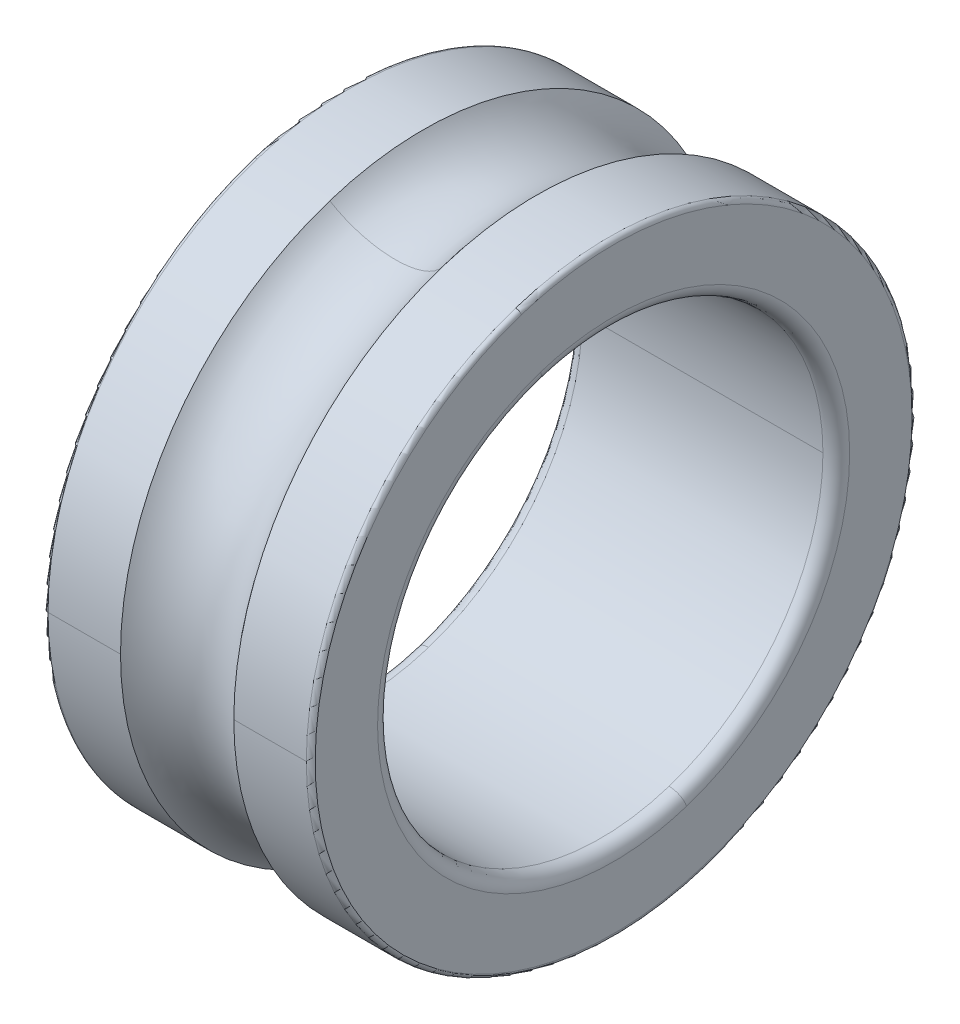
ISO-10303-21;
HEADER;
FILE_DESCRIPTION(('STEP AP214'),'2;1');
FILE_NAME('part.step','',(''),(''),'','','');
FILE_SCHEMA(('AUTOMOTIVE_DESIGN { 1 0 10303 214 1 1 1 1 }'));
ENDSEC;
DATA;
#1=APPLICATION_CONTEXT('core data for automotive mechanical design processes');
#2=APPLICATION_PROTOCOL_DEFINITION('international standard','automotive_design',2000,#1);
#3=PRODUCT_CONTEXT('',#1,'mechanical');
#4=PRODUCT('Part','Part','',(#3));
#5=PRODUCT_RELATED_PRODUCT_CATEGORY('part','',(#4));
#6=PRODUCT_DEFINITION_FORMATION('','',#4);
#7=PRODUCT_DEFINITION_CONTEXT('part definition',#1,'design');
#8=PRODUCT_DEFINITION('design','',#6,#7);
#9=PRODUCT_DEFINITION_SHAPE('','',#8);
#10=(LENGTH_UNIT() NAMED_UNIT(*) SI_UNIT(.MILLI.,.METRE.));
#11=(NAMED_UNIT(*) PLANE_ANGLE_UNIT() SI_UNIT($,.RADIAN.));
#12=(NAMED_UNIT(*) SI_UNIT($,.STERADIAN.) SOLID_ANGLE_UNIT());
#13=UNCERTAINTY_MEASURE_WITH_UNIT(LENGTH_MEASURE(1.E-05),#10,'distance_accuracy_value','');
#14=(GEOMETRIC_REPRESENTATION_CONTEXT(3) GLOBAL_UNCERTAINTY_ASSIGNED_CONTEXT((#13)) GLOBAL_UNIT_ASSIGNED_CONTEXT((#10,
#11,#12)) REPRESENTATION_CONTEXT('',''));
#15=CARTESIAN_POINT('',(0.,0.,0.));
#16=DIRECTION('',(0.,0.,1.));
#17=DIRECTION('',(1.,0.,0.));
#18=AXIS2_PLACEMENT_3D('',#15,#16,#17);
#19=CARTESIAN_POINT('',(0.,13.4,0.));
#20=DIRECTION('',(-1.,0.,0.));
#21=DIRECTION('',(0.,0.,1.));
#22=AXIS2_PLACEMENT_3D('',#19,#20,#21);
#23=PLANE('',#22);
#24=CARTESIAN_POINT('',(0.,0.,0.));
#25=DIRECTION('',(1.,0.,0.));
#26=DIRECTION('',(0.,0.,-1.));
#27=AXIS2_PLACEMENT_3D('',#24,#25,#26);
#28=CIRCLE('',#27,10.6);
#29=CARTESIAN_POINT('',(0.,10.0811990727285,3.2755801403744));
#30=VERTEX_POINT('',#29);
#31=CARTESIAN_POINT('',(0.,-10.0811990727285,-3.2755801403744));
#32=VERTEX_POINT('',#31);
#33=EDGE_CURVE('E11',#30,#32,#28,.T.);
#34=ORIENTED_EDGE('',*,*,#33,.T.);
#35=CARTESIAN_POINT('',(0.,-10.0811990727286,-3.27558014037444));
#36=CARTESIAN_POINT('',(0.,-9.56665124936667,-4.85911637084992));
#37=CARTESIAN_POINT('',(0.,-8.7413048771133,-6.34171740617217));
#38=CARTESIAN_POINT('',(0.,-7.63104492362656,-7.64159473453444));
#39=CARTESIAN_POINT('',(0.,-4.9606935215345,-9.73590550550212));
#40=CARTESIAN_POINT('',(0.,-1.69676522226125,-10.6652708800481));
#41=CARTESIAN_POINT('',(0.,0.00746025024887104,-10.7993992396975));
#42=CARTESIAN_POINT('',(0.,3.37658408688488,-10.3920572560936));
#43=CARTESIAN_POINT('',(0.,6.34169213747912,-8.74128253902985));
#44=CARTESIAN_POINT('',(0.,7.64160083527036,-7.63105181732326));
#45=CARTESIAN_POINT('',(0.,9.73590703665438,-4.96069051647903));
#46=CARTESIAN_POINT('',(0.,10.6652617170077,-1.69676433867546));
#47=CARTESIAN_POINT('',(0.,10.7994321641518,0.00745293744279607));
#48=CARTESIAN_POINT('',(0.,10.5957003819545,1.69202879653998));
#49=CARTESIAN_POINT('',(0.,10.0811990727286,3.27558014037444));
#50=B_SPLINE_CURVE_WITH_KNOTS('',5,(#35,#36,#37,#38,#39,#40,#41,#42,#43,#44,#45,#46,#47,#48,
#49),.UNSPECIFIED.,.F.,.F.,(6,3,3,3,6),(0.,0.785398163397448,1.5707963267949,2.35619449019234,
3.14159265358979),.UNSPECIFIED.);
#51=EDGE_CURVE('E26',#32,#30,#50,.T.);
#52=ORIENTED_EDGE('',*,*,#51,.T.);
#53=EDGE_LOOP('',(#34,#52));
#54=FACE_BOUND('',#53,.T.);
#55=CARTESIAN_POINT('',(0.,12.7441573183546,4.14082772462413));
#56=CARTESIAN_POINT('',(0.,12.6764075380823,4.3493551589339));
#57=CARTESIAN_POINT('',(0.,12.6035311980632,4.55621645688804));
#58=CARTESIAN_POINT('',(0.,12.447720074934,4.96611569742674));
#59=CARTESIAN_POINT('',(0.,12.3647852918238,5.16915364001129));
#60=CARTESIAN_POINT('',(0.,12.1890519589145,5.57091508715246));
#61=CARTESIAN_POINT('',(0.,12.0962534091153,5.76963859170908));
#62=CARTESIAN_POINT('',(0.,11.9010174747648,6.162292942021));
#63=CARTESIAN_POINT('',(0.,11.7985800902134,6.35622378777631));
#64=CARTESIAN_POINT('',(0.,11.5843128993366,6.73882548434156));
#65=CARTESIAN_POINT('',(0.,11.4724830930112,6.92749633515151));
#66=CARTESIAN_POINT('',(0.,11.2397005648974,7.29912355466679));
#67=CARTESIAN_POINT('',(0.,11.118747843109,7.48207992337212));
#68=CARTESIAN_POINT('',(0.,10.8680108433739,7.84183741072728));
#69=CARTESIAN_POINT('',(0.,10.7382265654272,8.0186385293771));
#70=CARTESIAN_POINT('',(0.,10.4701391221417,8.36565958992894));
#71=CARTESIAN_POINT('',(0.,10.3318359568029,8.53587953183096));
#72=CARTESIAN_POINT('',(0.,10.0470439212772,8.86932816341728));
#73=CARTESIAN_POINT('',(0.,9.90055505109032,9.03255685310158));
#74=CARTESIAN_POINT('',(0.,9.59974451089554,9.35162974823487));
#75=CARTESIAN_POINT('',(0.,9.44542284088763,9.50747395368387));
#76=CARTESIAN_POINT('',(0.,9.12931847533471,9.81140243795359));
#77=CARTESIAN_POINT('',(0.,8.96753577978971,9.95948671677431));
#78=CARTESIAN_POINT('',(0.,8.63689911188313,10.247538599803));
#79=CARTESIAN_POINT('',(0.,8.46804513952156,10.387506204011));
#80=CARTESIAN_POINT('',(0.,8.12367270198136,10.6589875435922));
#81=CARTESIAN_POINT('',(0.,7.94815423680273,10.7905012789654));
#82=CARTESIAN_POINT('',(0.,7.59087565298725,11.0447580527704));
#83=CARTESIAN_POINT('',(0.,7.4091155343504,11.1675010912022));
#84=CARTESIAN_POINT('',(0.,7.03979151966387,11.4039207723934));
#85=CARTESIAN_POINT('',(0.,6.85222762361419,11.5175974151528));
#86=CARTESIAN_POINT('',(0.,6.47174791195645,11.7356104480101));
#87=CARTESIAN_POINT('',(0.,6.27883209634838,11.8399468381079));
#88=CARTESIAN_POINT('',(0.,5.88811329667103,12.0390280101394));
#89=CARTESIAN_POINT('',(0.,5.69031031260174,12.1337727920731));
#90=CARTESIAN_POINT('',(0.,5.29029370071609,12.313442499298));
#91=CARTESIAN_POINT('',(0.,5.08808007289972,12.3983674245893));
#92=CARTESIAN_POINT('',(0.,4.67972932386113,12.5581928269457));
#93=CARTESIAN_POINT('',(0.,4.47359220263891,12.6330933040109));
#94=CARTESIAN_POINT('',(0.,4.05789106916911,12.7726893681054));
#95=CARTESIAN_POINT('',(0.,3.84832705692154,12.8373849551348));
#96=CARTESIAN_POINT('',(0.,3.42627699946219,12.9564153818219));
#97=CARTESIAN_POINT('',(0.,3.21379095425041,13.0107502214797));
#98=CARTESIAN_POINT('',(0.,2.78640872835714,13.1089282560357));
#99=CARTESIAN_POINT('',(0.,2.57151254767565,13.1527714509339));
#100=CARTESIAN_POINT('',(0.,2.1398277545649,13.2298605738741));
#101=CARTESIAN_POINT('',(0.,1.92303914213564,13.2631065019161));
#102=CARTESIAN_POINT('',(0.,1.48809174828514,13.3189209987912));
#103=CARTESIAN_POINT('',(0.,1.26993296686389,13.3414895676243));
#104=CARTESIAN_POINT('',(0.,0.83277079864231,13.3758949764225));
#105=CARTESIAN_POINT('',(0.,0.613767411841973,13.3877318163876));
#106=CARTESIAN_POINT('',(0.,0.175443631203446,13.4006452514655));
#107=CARTESIAN_POINT('',(0.,-0.0438767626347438,13.4017218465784));
#108=CARTESIAN_POINT('',(0.,-0.48230619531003,13.3931121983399));
#109=CARTESIAN_POINT('',(0.,-0.701415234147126,13.3834259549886));
#110=CARTESIAN_POINT('',(0.,-1.13889410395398,13.3533139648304));
#111=CARTESIAN_POINT('',(0.,-1.35726393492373,13.3328882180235));
#112=CARTESIAN_POINT('',(0.,-1.79273831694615,13.2813464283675));
#113=CARTESIAN_POINT('',(0.,-2.00984286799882,13.2502303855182));
#114=CARTESIAN_POINT('',(0.,-2.44226366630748,13.17738296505));
#115=CARTESIAN_POINT('',(0.,-2.65757991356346,13.135651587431));
#116=CARTESIAN_POINT('',(0.,-3.08590538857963,13.0416740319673));
#117=CARTESIAN_POINT('',(0.,-3.29891461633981,12.9894278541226));
#118=CARTESIAN_POINT('',(0.,-3.72211289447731,12.8745465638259));
#119=CARTESIAN_POINT('',(0.,-3.93230194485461,12.811911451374));
#120=CARTESIAN_POINT('',(0.,-4.3493535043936,12.6764031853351));
#121=CARTESIAN_POINT('',(0.,-4.55621601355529,12.6035300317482));
#122=CARTESIAN_POINT('',(0.,-4.96611614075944,12.4477212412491));
#123=CARTESIAN_POINT('',(0.,-5.16915375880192,12.364785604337));
#124=CARTESIAN_POINT('',(0.,-5.57091496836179,12.1890516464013));
#125=CARTESIAN_POINT('',(0.,-5.76963855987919,12.0962533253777));
#126=CARTESIAN_POINT('',(0.,-6.16229297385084,11.9010175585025));
#127=CARTESIAN_POINT('',(0.,-6.35622379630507,11.7985801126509));
#128=CARTESIAN_POINT('',(0.,-6.73882547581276,11.5843128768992));
#129=CARTESIAN_POINT('',(0.,-6.9274963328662,11.4724830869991));
#130=CARTESIAN_POINT('',(0.,-7.29912355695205,11.2397005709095));
#131=CARTESIAN_POINT('',(0.,-7.48207992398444,11.11874784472));
#132=CARTESIAN_POINT('',(0.,-7.84183741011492,10.868010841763));
#133=CARTESIAN_POINT('',(0.,-8.018638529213,10.7382265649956));
#134=CARTESIAN_POINT('',(0.,-8.36565959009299,10.4701391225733));
#135=CARTESIAN_POINT('',(0.,-8.5358795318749,10.3318359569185));
#136=CARTESIAN_POINT('',(0.,-8.86932816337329,10.0470439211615));
#137=CARTESIAN_POINT('',(0.,-9.03255685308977,9.90055505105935));
#138=CARTESIAN_POINT('',(0.,-9.35162974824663,9.59974451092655));
#139=CARTESIAN_POINT('',(0.,-9.50747395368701,9.44542284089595));
#140=CARTESIAN_POINT('',(0.,-9.81140243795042,9.12931847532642));
#141=CARTESIAN_POINT('',(0.,-9.95948671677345,8.9675357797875));
#142=CARTESIAN_POINT('',(0.,-10.2475385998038,8.63689911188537));
#143=CARTESIAN_POINT('',(0.,-10.3875062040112,8.46804513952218));
#144=CARTESIAN_POINT('',(0.,-10.6589875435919,8.12367270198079));
#145=CARTESIAN_POINT('',(0.,-10.7905012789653,7.94815423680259));
#146=CARTESIAN_POINT('',(0.,-11.0447580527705,7.59087565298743));
#147=CARTESIAN_POINT('',(0.,-11.1675010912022,7.40911553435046));
#148=CARTESIAN_POINT('',(0.,-11.4039207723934,7.03979151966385));
#149=CARTESIAN_POINT('',(0.,-11.5175974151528,6.85222762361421));
#150=CARTESIAN_POINT('',(0.,-11.73561044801,6.47174791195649));
#151=CARTESIAN_POINT('',(0.,-11.8399468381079,6.27883209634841));
#152=CARTESIAN_POINT('',(0.,-12.0390280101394,5.88811329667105));
#153=CARTESIAN_POINT('',(0.,-12.1337727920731,5.69031031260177));
#154=CARTESIAN_POINT('',(0.,-12.3134424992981,5.29029370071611));
#155=CARTESIAN_POINT('',(0.,-12.3983674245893,5.08808007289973));
#156=CARTESIAN_POINT('',(0.,-12.5581928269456,4.67972932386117));
#157=CARTESIAN_POINT('',(0.,-12.6330933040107,4.47359220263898));
#158=CARTESIAN_POINT('',(0.,-12.7726893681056,4.0578910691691));
#159=CARTESIAN_POINT('',(0.,-12.8373849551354,3.8483270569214));
#160=CARTESIAN_POINT('',(0.,-12.9564153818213,3.42627699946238));
#161=CARTESIAN_POINT('',(0.,-13.0107502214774,3.21379095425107));
#162=CARTESIAN_POINT('',(0.,-13.108928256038,2.78640872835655));
#163=CARTESIAN_POINT('',(0.,-13.1527714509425,2.57151254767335));
#164=CARTESIAN_POINT('',(0.,-13.2298605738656,2.13982775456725));
#165=CARTESIAN_POINT('',(0.,-13.2631065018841,1.92303914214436));
#166=CARTESIAN_POINT('',(0.,-13.3189209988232,1.48809174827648));
#167=CARTESIAN_POINT('',(0.,-13.3414895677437,1.2699329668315));
#168=CARTESIAN_POINT('',(0.,-13.3758949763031,0.832770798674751));
#169=CARTESIAN_POINT('',(0.,-13.3877318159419,0.613767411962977));
#170=CARTESIAN_POINT('',(0.,-13.4006452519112,0.175443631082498));
#171=CARTESIAN_POINT('',(0.,-13.4017218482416,-0.0438767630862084));
#172=CARTESIAN_POINT('',(0.,-13.3931121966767,-0.482306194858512));
#173=CARTESIAN_POINT('',(0.,-13.3834259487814,-0.701415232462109));
#174=CARTESIAN_POINT('',(0.,-13.3533139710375,-1.13889410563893));
#175=CARTESIAN_POINT('',(0.,-13.3328882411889,-1.35726394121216));
#176=CARTESIAN_POINT('',(0.,-13.2813464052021,-1.79273831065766));
#177=CARTESIAN_POINT('',(0.,-13.2502302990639,-2.00984284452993));
#178=CARTESIAN_POINT('',(0.,-13.1773830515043,-2.44226368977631));
#179=CARTESIAN_POINT('',(0.,-13.1356519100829,-2.65758000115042));
#180=CARTESIAN_POINT('',(0.,-13.0416737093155,-3.08590530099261));
#181=CARTESIAN_POINT('',(0.,-12.9894266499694,-3.29891428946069));
#182=CARTESIAN_POINT('',(0.,-12.8745477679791,-3.72211322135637));
#183=CARTESIAN_POINT('',(0.,-12.8119159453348,-3.93230316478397));
#184=CARTESIAN_POINT('',(0.,-12.7441573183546,-4.14082772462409));
#185=B_SPLINE_CURVE_WITH_KNOTS('',3,(#55,#56,#57,#58,#59,#60,#61,#62,#63,#64,#65,#66,#67,#68,
#69,#70,#71,#72,#73,#74,#75,#76,#77,#78,#79,#80,#81,#82,#83,#84,#85,#86,#87,#88,#89,#90,#91,#92,
#93,#94,#95,#96,#97,#98,#99,#100,#101,#102,#103,#104,#105,#106,#107,#108,#109,#110,#111,#112,
#113,#114,#115,#116,#117,#118,#119,#120,#121,#122,#123,#124,#125,#126,#127,#128,#129,#130,#131,
#132,#133,#134,#135,#136,#137,#138,#139,#140,#141,#142,#143,#144,#145,#146,#147,#148,#149,#150,
#151,#152,#153,#154,#155,#156,#157,#158,#159,#160,#161,#162,#163,#164,#165,#166,#167,#168,#169,
#170,#171,#172,#173,#174,#175,#176,#177,#178,#179,#180,#181,#182,#183,#184),.UNSPECIFIED.,.F.,
.F.,(4,2,2,2,2,2,2,2,2,2,2,2,2,2,2,2,2,2,2,2,2,2,2,2,2,2,2,2,2,2,2,2,2,2,2,2,2,2,2,2,2,2,2,2,2,
2,2,2,2,2,2,2,2,2,2,2,2,2,2,2,2,2,2,2,4),(0.,0.657704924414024,1.31540984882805,
1.97311477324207,2.63081969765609,3.28852462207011,3.94622954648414,4.60393447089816,
5.26163939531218,5.91934431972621,6.57704924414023,7.23475416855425,7.89245909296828,
8.5501640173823,9.20786894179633,9.86557386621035,10.5232787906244,11.1809837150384,
11.8386886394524,12.4963935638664,13.1540984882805,13.8118034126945,14.4695083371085,
15.1272132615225,15.7849181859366,16.4426231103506,17.1003280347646,17.7580329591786,
18.4157378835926,19.0734428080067,19.7311477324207,20.3888526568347,21.0465575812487,
21.7042625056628,22.3619674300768,23.0196723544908,23.6773772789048,24.3350822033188,
24.9927871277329,25.6504920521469,26.3081969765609,26.9659019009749,27.623606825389,
28.281311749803,28.939016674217,29.596721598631,30.2544265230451,30.9121314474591,
31.5698363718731,32.2275412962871,32.8852462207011,33.5429511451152,34.2006560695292,
34.8583609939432,35.5160659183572,36.1737708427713,36.8314757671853,37.4891806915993,
38.1468856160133,38.8045905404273,39.4622954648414,40.1200003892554,40.7777053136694,
41.4354102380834,42.0931151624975),.UNSPECIFIED.);
#186=CARTESIAN_POINT('',(0.,12.7441573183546,4.14082772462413));
#187=VERTEX_POINT('',#186);
#188=CARTESIAN_POINT('',(0.,-12.7441573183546,-4.14082772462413));
#189=VERTEX_POINT('',#188);
#190=EDGE_CURVE('E330',#187,#189,#185,.T.);
#191=ORIENTED_EDGE('',*,*,#190,.F.);
#192=CARTESIAN_POINT('',(0.,-12.7441573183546,-4.14082772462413));
#193=CARTESIAN_POINT('',(0.,-12.6764075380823,-4.3493551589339));
#194=CARTESIAN_POINT('',(0.,-12.6035311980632,-4.55621645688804));
#195=CARTESIAN_POINT('',(0.,-12.447720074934,-4.96611569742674));
#196=CARTESIAN_POINT('',(0.,-12.3647852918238,-5.16915364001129));
#197=CARTESIAN_POINT('',(0.,-12.1890519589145,-5.57091508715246));
#198=CARTESIAN_POINT('',(0.,-12.0962534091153,-5.76963859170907));
#199=CARTESIAN_POINT('',(0.,-11.9010174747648,-6.162292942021));
#200=CARTESIAN_POINT('',(0.,-11.7985800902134,-6.35622378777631));
#201=CARTESIAN_POINT('',(0.,-11.5843128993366,-6.73882548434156));
#202=CARTESIAN_POINT('',(0.,-11.4724830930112,-6.9274963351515));
#203=CARTESIAN_POINT('',(0.,-11.2397005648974,-7.29912355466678));
#204=CARTESIAN_POINT('',(0.,-11.118747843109,-7.48207992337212));
#205=CARTESIAN_POINT('',(0.,-10.8680108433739,-7.84183741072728));
#206=CARTESIAN_POINT('',(0.,-10.7382265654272,-8.0186385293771));
#207=CARTESIAN_POINT('',(0.,-10.4701391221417,-8.36565958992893));
#208=CARTESIAN_POINT('',(0.,-10.3318359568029,-8.53587953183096));
#209=CARTESIAN_POINT('',(0.,-10.0470439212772,-8.86932816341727));
#210=CARTESIAN_POINT('',(0.,-9.90055505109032,-9.03255685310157));
#211=CARTESIAN_POINT('',(0.,-9.59974451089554,-9.35162974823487));
#212=CARTESIAN_POINT('',(0.,-9.44542284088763,-9.50747395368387));
#213=CARTESIAN_POINT('',(0.,-9.12931847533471,-9.81140243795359));
#214=CARTESIAN_POINT('',(0.,-8.96753577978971,-9.95948671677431));
#215=CARTESIAN_POINT('',(0.,-8.63689911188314,-10.247538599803));
#216=CARTESIAN_POINT('',(0.,-8.46804513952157,-10.387506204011));
#217=CARTESIAN_POINT('',(0.,-8.12367270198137,-10.6589875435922));
#218=CARTESIAN_POINT('',(0.,-7.94815423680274,-10.7905012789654));
#219=CARTESIAN_POINT('',(0.,-7.59087565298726,-11.0447580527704));
#220=CARTESIAN_POINT('',(0.,-7.4091155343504,-11.1675010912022));
#221=CARTESIAN_POINT('',(0.,-7.03979151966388,-11.4039207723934));
#222=CARTESIAN_POINT('',(0.,-6.8522276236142,-11.5175974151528));
#223=CARTESIAN_POINT('',(0.,-6.47174791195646,-11.7356104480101));
#224=CARTESIAN_POINT('',(0.,-6.27883209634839,-11.8399468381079));
#225=CARTESIAN_POINT('',(0.,-5.88811329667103,-12.0390280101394));
#226=CARTESIAN_POINT('',(0.,-5.69031031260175,-12.1337727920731));
#227=CARTESIAN_POINT('',(0.,-5.29029370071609,-12.313442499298));
#228=CARTESIAN_POINT('',(0.,-5.08808007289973,-12.3983674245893));
#229=CARTESIAN_POINT('',(0.,-4.67972932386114,-12.5581928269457));
#230=CARTESIAN_POINT('',(0.,-4.47359220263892,-12.6330933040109));
#231=CARTESIAN_POINT('',(0.,-4.05789106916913,-12.7726893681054));
#232=CARTESIAN_POINT('',(0.,-3.84832705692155,-12.8373849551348));
#233=CARTESIAN_POINT('',(0.,-3.4262769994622,-12.9564153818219));
#234=CARTESIAN_POINT('',(0.,-3.21379095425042,-13.0107502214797));
#235=CARTESIAN_POINT('',(0.,-2.78640872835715,-13.1089282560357));
#236=CARTESIAN_POINT('',(0.,-2.57151254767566,-13.1527714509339));
#237=CARTESIAN_POINT('',(0.,-2.13982775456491,-13.2298605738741));
#238=CARTESIAN_POINT('',(0.,-1.92303914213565,-13.2631065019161));
#239=CARTESIAN_POINT('',(0.,-1.48809174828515,-13.3189209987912));
#240=CARTESIAN_POINT('',(0.,-1.2699329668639,-13.3414895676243));
#241=CARTESIAN_POINT('',(0.,-0.832770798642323,-13.3758949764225));
#242=CARTESIAN_POINT('',(0.,-0.613767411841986,-13.3877318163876));
#243=CARTESIAN_POINT('',(0.,-0.175443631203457,-13.4006452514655));
#244=CARTESIAN_POINT('',(0.,0.0438767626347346,-13.4017218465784));
#245=CARTESIAN_POINT('',(0.,0.482306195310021,-13.3931121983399));
#246=CARTESIAN_POINT('',(0.,0.701415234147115,-13.3834259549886));
#247=CARTESIAN_POINT('',(0.,1.13889410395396,-13.3533139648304));
#248=CARTESIAN_POINT('',(0.,1.35726393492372,-13.3328882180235));
#249=CARTESIAN_POINT('',(0.,1.79273831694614,-13.2813464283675));
#250=CARTESIAN_POINT('',(0.,2.0098428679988,-13.2502303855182));
#251=CARTESIAN_POINT('',(0.,2.44226366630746,-13.17738296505));
#252=CARTESIAN_POINT('',(0.,2.65757991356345,-13.1356515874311));
#253=CARTESIAN_POINT('',(0.,3.08590538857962,-13.0416740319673));
#254=CARTESIAN_POINT('',(0.,3.2989146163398,-12.9894278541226));
#255=CARTESIAN_POINT('',(0.,3.7221128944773,-12.8745465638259));
#256=CARTESIAN_POINT('',(0.,3.9323019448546,-12.811911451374));
#257=CARTESIAN_POINT('',(0.,4.34935350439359,-12.6764031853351));
#258=CARTESIAN_POINT('',(0.,4.55621601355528,-12.6035300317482));
#259=CARTESIAN_POINT('',(0.,4.96611614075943,-12.4477212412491));
#260=CARTESIAN_POINT('',(0.,5.1691537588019,-12.364785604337));
#261=CARTESIAN_POINT('',(0.,5.57091496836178,-12.1890516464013));
#262=CARTESIAN_POINT('',(0.,5.76963855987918,-12.0962533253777));
#263=CARTESIAN_POINT('',(0.,6.16229297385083,-11.9010175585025));
#264=CARTESIAN_POINT('',(0.,6.35622379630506,-11.7985801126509));
#265=CARTESIAN_POINT('',(0.,6.73882547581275,-11.5843128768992));
#266=CARTESIAN_POINT('',(0.,6.92749633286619,-11.4724830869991));
#267=CARTESIAN_POINT('',(0.,7.29912355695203,-11.2397005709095));
#268=CARTESIAN_POINT('',(0.,7.48207992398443,-11.11874784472));
#269=CARTESIAN_POINT('',(0.,7.84183741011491,-10.868010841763));
#270=CARTESIAN_POINT('',(0.,8.01863852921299,-10.7382265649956));
#271=CARTESIAN_POINT('',(0.,8.36565959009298,-10.4701391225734));
#272=CARTESIAN_POINT('',(0.,8.53587953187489,-10.3318359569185));
#273=CARTESIAN_POINT('',(0.,8.86932816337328,-10.0470439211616));
#274=CARTESIAN_POINT('',(0.,9.03255685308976,-9.90055505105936));
#275=CARTESIAN_POINT('',(0.,9.35162974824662,-9.59974451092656));
#276=CARTESIAN_POINT('',(0.,9.507473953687,-9.44542284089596));
#277=CARTESIAN_POINT('',(0.,9.81140243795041,-9.12931847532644));
#278=CARTESIAN_POINT('',(0.,9.95948671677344,-8.96753577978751));
#279=CARTESIAN_POINT('',(0.,10.2475385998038,-8.63689911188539));
#280=CARTESIAN_POINT('',(0.,10.3875062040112,-8.46804513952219));
#281=CARTESIAN_POINT('',(0.,10.6589875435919,-8.1236727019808));
#282=CARTESIAN_POINT('',(0.,10.7905012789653,-7.94815423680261));
#283=CARTESIAN_POINT('',(0.,11.0447580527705,-7.59087565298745));
#284=CARTESIAN_POINT('',(0.,11.1675010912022,-7.40911553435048));
#285=CARTESIAN_POINT('',(0.,11.4039207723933,-7.03979151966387));
#286=CARTESIAN_POINT('',(0.,11.5175974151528,-6.85222762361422));
#287=CARTESIAN_POINT('',(0.,11.73561044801,-6.4717479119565));
#288=CARTESIAN_POINT('',(0.,11.8399468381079,-6.27883209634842));
#289=CARTESIAN_POINT('',(0.,12.0390280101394,-5.88811329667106));
#290=CARTESIAN_POINT('',(0.,12.1337727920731,-5.69031031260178));
#291=CARTESIAN_POINT('',(0.,12.313442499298,-5.29029370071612));
#292=CARTESIAN_POINT('',(0.,12.3983674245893,-5.08808007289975));
#293=CARTESIAN_POINT('',(0.,12.5581928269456,-4.67972932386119));
#294=CARTESIAN_POINT('',(0.,12.6330933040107,-4.473592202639));
#295=CARTESIAN_POINT('',(0.,12.7726893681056,-4.05789106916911));
#296=CARTESIAN_POINT('',(0.,12.8373849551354,-3.84832705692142));
#297=CARTESIAN_POINT('',(0.,12.9564153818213,-3.4262769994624));
#298=CARTESIAN_POINT('',(0.,13.0107502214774,-3.21379095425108));
#299=CARTESIAN_POINT('',(0.,13.108928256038,-2.78640872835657));
#300=CARTESIAN_POINT('',(0.,13.1527714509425,-2.57151254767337));
#301=CARTESIAN_POINT('',(0.,13.2298605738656,-2.13982775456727));
#302=CARTESIAN_POINT('',(0.,13.2631065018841,-1.92303914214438));
#303=CARTESIAN_POINT('',(0.,13.3189209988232,-1.4880917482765));
#304=CARTESIAN_POINT('',(0.,13.3414895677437,-1.26993296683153));
#305=CARTESIAN_POINT('',(0.,13.3758949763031,-0.832770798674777));
#306=CARTESIAN_POINT('',(0.,13.3877318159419,-0.613767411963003));
#307=CARTESIAN_POINT('',(0.,13.4006452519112,-0.175443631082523));
#308=CARTESIAN_POINT('',(0.,13.4017218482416,0.0438767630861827));
#309=CARTESIAN_POINT('',(0.,13.3931121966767,0.482306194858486));
#310=CARTESIAN_POINT('',(0.,13.3834259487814,0.701415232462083));
#311=CARTESIAN_POINT('',(0.,13.3533139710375,1.13889410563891));
#312=CARTESIAN_POINT('',(0.,13.3328882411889,1.35726394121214));
#313=CARTESIAN_POINT('',(0.,13.2813464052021,1.79273831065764));
#314=CARTESIAN_POINT('',(0.,13.2502302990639,2.00984284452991));
#315=CARTESIAN_POINT('',(0.,13.1773830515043,2.44226368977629));
#316=CARTESIAN_POINT('',(0.,13.1356519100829,2.6575800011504));
#317=CARTESIAN_POINT('',(0.,13.0416737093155,3.08590530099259));
#318=CARTESIAN_POINT('',(0.,12.9894266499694,3.29891428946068));
#319=CARTESIAN_POINT('',(0.,12.8745477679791,3.72211322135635));
#320=CARTESIAN_POINT('',(0.,12.8119159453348,3.93230316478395));
#321=CARTESIAN_POINT('',(0.,12.7441573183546,4.14082772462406));
#322=B_SPLINE_CURVE_WITH_KNOTS('',3,(#192,#193,#194,#195,#196,#197,#198,#199,#200,#201,#202,
#203,#204,#205,#206,#207,#208,#209,#210,#211,#212,#213,#214,#215,#216,#217,#218,#219,#220,#221,
#222,#223,#224,#225,#226,#227,#228,#229,#230,#231,#232,#233,#234,#235,#236,#237,#238,#239,#240,
#241,#242,#243,#244,#245,#246,#247,#248,#249,#250,#251,#252,#253,#254,#255,#256,#257,#258,#259,
#260,#261,#262,#263,#264,#265,#266,#267,#268,#269,#270,#271,#272,#273,#274,#275,#276,#277,#278,
#279,#280,#281,#282,#283,#284,#285,#286,#287,#288,#289,#290,#291,#292,#293,#294,#295,#296,#297,
#298,#299,#300,#301,#302,#303,#304,#305,#306,#307,#308,#309,#310,#311,#312,#313,#314,#315,#316,
#317,#318,#319,#320,#321),.UNSPECIFIED.,.F.,.F.,(4,2,2,2,2,2,2,2,2,2,2,2,2,2,2,2,2,2,2,2,2,2,2,
2,2,2,2,2,2,2,2,2,2,2,2,2,2,2,2,2,2,2,2,2,2,2,2,2,2,2,2,2,2,2,2,2,2,2,2,2,2,2,2,2,4),(0.,
0.657704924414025,1.31540984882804,1.97311477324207,2.63081969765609,3.28852462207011,
3.94622954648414,4.60393447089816,5.26163939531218,5.91934431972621,6.57704924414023,
7.23475416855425,7.89245909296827,8.55016401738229,9.20786894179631,9.86557386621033,
10.5232787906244,11.1809837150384,11.8386886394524,12.4963935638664,13.1540984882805,
13.8118034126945,14.4695083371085,15.1272132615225,15.7849181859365,16.4426231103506,
17.1003280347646,17.7580329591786,18.4157378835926,19.0734428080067,19.7311477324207,
20.3888526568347,21.0465575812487,21.7042625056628,22.3619674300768,23.0196723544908,
23.6773772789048,24.3350822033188,24.9927871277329,25.6504920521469,26.3081969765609,
26.9659019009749,27.623606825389,28.281311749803,28.939016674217,29.596721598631,
30.254426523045,30.9121314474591,31.5698363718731,32.2275412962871,32.8852462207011,
33.5429511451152,34.2006560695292,34.8583609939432,35.5160659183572,36.1737708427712,
36.8314757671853,37.4891806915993,38.1468856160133,38.8045905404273,39.4622954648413,
40.1200003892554,40.7777053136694,41.4354102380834,42.0931151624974),.UNSPECIFIED.);
#323=EDGE_CURVE('E436',#189,#187,#322,.T.);
#324=ORIENTED_EDGE('',*,*,#323,.F.);
#325=EDGE_LOOP('',(#191,#324));
#326=FACE_BOUND('',#325,.T.);
#327=ADVANCED_FACE('F17',(#54,#326),#23,.T.);
#328=CARTESIAN_POINT('',(0.200000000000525,0.,0.));
#329=DIRECTION('',(1.,0.,0.));
#330=DIRECTION('',(0.,-0.309016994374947,0.951056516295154));
#331=AXIS2_PLACEMENT_3D('',#328,#329,#330);
#332=TOROIDAL_SURFACE('',#331,13.3999999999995,0.200000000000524);
#333=CARTESIAN_POINT('',(0.200000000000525,-12.7441573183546,-4.14082772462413));
#334=DIRECTION('',(0.,0.309016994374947,-0.951056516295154));
#335=DIRECTION('',(-2.60097499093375E-12,-0.951056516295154,-0.309016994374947));
#336=AXIS2_PLACEMENT_3D('',#333,#334,#335);
#337=CIRCLE('',#336,0.200000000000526);
#338=CARTESIAN_POINT('',(0.200000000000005,-12.9343686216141,-4.20263112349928));
#339=VERTEX_POINT('',#338);
#340=EDGE_CURVE('E402',#339,#189,#337,.T.);
#341=ORIENTED_EDGE('',*,*,#340,.T.);
#342=ORIENTED_EDGE('',*,*,#323,.T.);
#343=CARTESIAN_POINT('',(0.200000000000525,12.7441573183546,4.14082772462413));
#344=DIRECTION('',(0.,-0.309016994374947,0.951056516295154));
#345=DIRECTION('',(-2.60014232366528E-12,0.951056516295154,0.309016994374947));
#346=AXIS2_PLACEMENT_3D('',#343,#344,#345);
#347=CIRCLE('',#346,0.200000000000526);
#348=CARTESIAN_POINT('',(0.200000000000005,12.9343686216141,4.20263112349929));
#349=VERTEX_POINT('',#348);
#350=EDGE_CURVE('E398',#349,#187,#347,.T.);
#351=ORIENTED_EDGE('',*,*,#350,.F.);
#352=CARTESIAN_POINT('',(0.200000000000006,0.,0.));
#353=DIRECTION('',(1.,0.,0.));
#354=DIRECTION('',(0.,0.,-1.));
#355=AXIS2_PLACEMENT_3D('',#352,#353,#354);
#356=CIRCLE('',#355,13.6);
#357=CARTESIAN_POINT('',(0.200000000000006,0.,-13.6));
#358=VERTEX_POINT('',#357);
#359=EDGE_CURVE('E393',#358,#349,#356,.T.);
#360=ORIENTED_EDGE('',*,*,#359,.F.);
#361=CARTESIAN_POINT('',(0.200000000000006,0.,0.));
#362=DIRECTION('',(1.,0.,0.));
#363=DIRECTION('',(0.,0.,-1.));
#364=AXIS2_PLACEMENT_3D('',#361,#362,#363);
#365=CIRCLE('',#364,13.6);
#366=EDGE_CURVE('E388',#339,#358,#365,.T.);
#367=ORIENTED_EDGE('',*,*,#366,.F.);
#368=EDGE_LOOP('',(#341,#342,#351,#360,#367));
#369=FACE_BOUND('',#368,.T.);
#370=ADVANCED_FACE('F410',(#369),#332,.T.);
#371=CARTESIAN_POINT('',(100.,0.,0.));
#372=DIRECTION('',(1.,0.,0.));
#373=DIRECTION('',(0.,1.,0.));
#374=AXIS2_PLACEMENT_3D('',#371,#372,#373);
#375=CYLINDRICAL_SURFACE('',#374,13.6);
#376=DIRECTION('',(1.,0.,0.));
#377=VECTOR('',#376,1.);
#378=CARTESIAN_POINT('',(0.200000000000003,0.,13.6));
#379=LINE('',#378,#377);
#380=CARTESIAN_POINT('',(0.200000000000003,0.,13.6));
#381=VERTEX_POINT('',#380);
#382=CARTESIAN_POINT('',(3.4562576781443,0.,13.6));
#383=VERTEX_POINT('',#382);
#384=EDGE_CURVE('E383',#381,#383,#379,.T.);
#385=ORIENTED_EDGE('',*,*,#384,.F.);
#386=CARTESIAN_POINT('',(0.200000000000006,0.,0.));
#387=DIRECTION('',(1.,0.,0.));
#388=DIRECTION('',(0.,0.,-1.));
#389=AXIS2_PLACEMENT_3D('',#386,#387,#388);
#390=CIRCLE('',#389,13.6);
#391=EDGE_CURVE('E378',#381,#339,#390,.T.);
#392=ORIENTED_EDGE('',*,*,#391,.T.);
#393=ORIENTED_EDGE('',*,*,#366,.T.);
#394=DIRECTION('',(1.,0.,0.));
#395=VECTOR('',#394,1.);
#396=CARTESIAN_POINT('',(0.200000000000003,0.,-13.6));
#397=LINE('',#396,#395);
#398=CARTESIAN_POINT('',(3.45625767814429,0.,-13.6));
#399=VERTEX_POINT('',#398);
#400=EDGE_CURVE('E374',#358,#399,#397,.T.);
#401=ORIENTED_EDGE('',*,*,#400,.T.);
#402=CARTESIAN_POINT('',(3.45625767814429,0.,0.));
#403=DIRECTION('',(1.,0.,0.));
#404=DIRECTION('',(0.,0.,-1.));
#405=AXIS2_PLACEMENT_3D('',#402,#403,#404);
#406=CIRCLE('',#405,13.6);
#407=CARTESIAN_POINT('',(3.45625767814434,-12.9343686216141,-4.20263112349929));
#408=VERTEX_POINT('',#407);
#409=EDGE_CURVE('E369',#408,#399,#406,.T.);
#410=ORIENTED_EDGE('',*,*,#409,.F.);
#411=CARTESIAN_POINT('',(3.45625767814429,0.,0.));
#412=DIRECTION('',(1.,0.,0.));
#413=DIRECTION('',(0.,0.,-1.));
#414=AXIS2_PLACEMENT_3D('',#411,#412,#413);
#415=CIRCLE('',#414,13.6);
#416=EDGE_CURVE('E364',#383,#408,#415,.T.);
#417=ORIENTED_EDGE('',*,*,#416,.F.);
#418=EDGE_LOOP('',(#385,#392,#393,#401,#410,#417));
#419=FACE_BOUND('',#418,.T.);
#420=ADVANCED_FACE('F419',(#419),#375,.T.);
#421=CARTESIAN_POINT('',(6.,0.,0.));
#422=DIRECTION('',(1.,0.,0.));
#423=DIRECTION('',(0.,0.309016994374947,-0.951056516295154));
#424=AXIS2_PLACEMENT_3D('',#421,#422,#423);
#425=TOROIDAL_SURFACE('',#424,15.5,3.17499999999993);
#426=CARTESIAN_POINT('',(6.,-14.7413760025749,-4.78976341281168));
#427=DIRECTION('',(0.,0.309016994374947,-0.951056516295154));
#428=DIRECTION('',(-0.801178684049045,0.569136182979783,0.184923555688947));
#429=AXIS2_PLACEMENT_3D('',#426,#427,#428);
#430=CIRCLE('',#429,3.17499999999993);
#431=CARTESIAN_POINT('',(8.54374232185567,-12.9343686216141,-4.20263112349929));
#432=VERTEX_POINT('',#431);
#433=EDGE_CURVE('E360',#408,#432,#430,.T.);
#434=ORIENTED_EDGE('',*,*,#433,.T.);
#435=CARTESIAN_POINT('',(8.5437423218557,0.,0.));
#436=DIRECTION('',(1.,0.,0.));
#437=DIRECTION('',(0.,0.,-1.));
#438=AXIS2_PLACEMENT_3D('',#435,#436,#437);
#439=CIRCLE('',#438,13.6);
#440=CARTESIAN_POINT('',(8.5437423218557,0.,13.6));
#441=VERTEX_POINT('',#440);
#442=EDGE_CURVE('E355',#441,#432,#439,.T.);
#443=ORIENTED_EDGE('',*,*,#442,.F.);
#444=CARTESIAN_POINT('',(8.5437423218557,0.,0.));
#445=DIRECTION('',(1.,0.,0.));
#446=DIRECTION('',(0.,0.,-1.));
#447=AXIS2_PLACEMENT_3D('',#444,#445,#446);
#448=CIRCLE('',#447,13.6);
#449=CARTESIAN_POINT('',(8.54374232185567,12.9343686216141,4.20263112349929));
#450=VERTEX_POINT('',#449);
#451=EDGE_CURVE('E350',#450,#441,#448,.T.);
#452=ORIENTED_EDGE('',*,*,#451,.F.);
#453=CARTESIAN_POINT('',(6.,14.7413760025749,4.78976341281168));
#454=DIRECTION('',(0.,-0.309016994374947,0.951056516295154));
#455=DIRECTION('',(-0.801178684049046,-0.569136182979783,-0.184923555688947));
#456=AXIS2_PLACEMENT_3D('',#453,#454,#455);
#457=CIRCLE('',#456,3.17499999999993);
#458=CARTESIAN_POINT('',(3.45625767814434,12.9343686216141,4.20263112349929));
#459=VERTEX_POINT('',#458);
#460=EDGE_CURVE('E345',#459,#450,#457,.T.);
#461=ORIENTED_EDGE('',*,*,#460,.F.);
#462=CARTESIAN_POINT('',(3.45625767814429,0.,0.));
#463=DIRECTION('',(1.,0.,0.));
#464=DIRECTION('',(0.,0.,-1.));
#465=AXIS2_PLACEMENT_3D('',#462,#463,#464);
#466=CIRCLE('',#465,13.6);
#467=EDGE_CURVE('E340',#459,#383,#466,.T.);
#468=ORIENTED_EDGE('',*,*,#467,.T.);
#469=ORIENTED_EDGE('',*,*,#416,.T.);
#470=EDGE_LOOP('',(#434,#443,#452,#461,#468,#469));
#471=FACE_BOUND('',#470,.T.);
#472=ADVANCED_FACE('F422',(#471),#425,.F.);
#473=CARTESIAN_POINT('',(100.,0.,0.));
#474=DIRECTION('',(1.,0.,0.));
#475=DIRECTION('',(0.,-1.,0.));
#476=AXIS2_PLACEMENT_3D('',#473,#474,#475);
#477=CYLINDRICAL_SURFACE('',#476,13.6);
#478=ORIENTED_EDGE('',*,*,#384,.T.);
#479=ORIENTED_EDGE('',*,*,#467,.F.);
#480=CARTESIAN_POINT('',(3.45625767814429,0.,0.));
#481=DIRECTION('',(1.,0.,0.));
#482=DIRECTION('',(0.,0.,-1.));
#483=AXIS2_PLACEMENT_3D('',#480,#481,#482);
#484=CIRCLE('',#483,13.6);
#485=EDGE_CURVE('E334',#399,#459,#484,.T.);
#486=ORIENTED_EDGE('',*,*,#485,.F.);
#487=ORIENTED_EDGE('',*,*,#400,.F.);
#488=ORIENTED_EDGE('',*,*,#359,.T.);
#489=CARTESIAN_POINT('',(0.200000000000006,0.,0.));
#490=DIRECTION('',(1.,0.,0.));
#491=DIRECTION('',(0.,0.,-1.));
#492=AXIS2_PLACEMENT_3D('',#489,#490,#491);
#493=CIRCLE('',#492,13.6);
#494=EDGE_CURVE('E331',#349,#381,#493,.T.);
#495=ORIENTED_EDGE('',*,*,#494,.T.);
#496=EDGE_LOOP('',(#478,#479,#486,#487,#488,#495));
#497=FACE_BOUND('',#496,.T.);
#498=ADVANCED_FACE('F311',(#497),#477,.T.);
#499=CARTESIAN_POINT('',(0.200000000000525,0.,0.));
#500=DIRECTION('',(1.,0.,0.));
#501=DIRECTION('',(0.,0.309016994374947,-0.951056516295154));
#502=AXIS2_PLACEMENT_3D('',#499,#500,#501);
#503=TOROIDAL_SURFACE('',#502,13.3999999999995,0.200000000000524);
#504=ORIENTED_EDGE('',*,*,#340,.F.);
#505=ORIENTED_EDGE('',*,*,#391,.F.);
#506=ORIENTED_EDGE('',*,*,#494,.F.);
#507=ORIENTED_EDGE('',*,*,#350,.T.);
#508=ORIENTED_EDGE('',*,*,#190,.T.);
#509=EDGE_LOOP('',(#504,#505,#506,#507,#508));
#510=FACE_BOUND('',#509,.T.);
#511=ADVANCED_FACE('F306',(#510),#503,.T.);
#512=CARTESIAN_POINT('',(6.,0.,0.));
#513=DIRECTION('',(1.,0.,0.));
#514=DIRECTION('',(0.,-0.309016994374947,0.951056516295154));
#515=AXIS2_PLACEMENT_3D('',#512,#513,#514);
#516=TOROIDAL_SURFACE('',#515,15.5,3.17499999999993);
#517=ORIENTED_EDGE('',*,*,#433,.F.);
#518=ORIENTED_EDGE('',*,*,#409,.T.);
#519=ORIENTED_EDGE('',*,*,#485,.T.);
#520=ORIENTED_EDGE('',*,*,#460,.T.);
#521=CARTESIAN_POINT('',(8.5437423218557,0.,0.));
#522=DIRECTION('',(1.,0.,0.));
#523=DIRECTION('',(0.,0.,-1.));
#524=AXIS2_PLACEMENT_3D('',#521,#522,#523);
#525=CIRCLE('',#524,13.6);
#526=CARTESIAN_POINT('',(8.5437423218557,0.,-13.6));
#527=VERTEX_POINT('',#526);
#528=EDGE_CURVE('E335',#527,#450,#525,.T.);
#529=ORIENTED_EDGE('',*,*,#528,.F.);
#530=CARTESIAN_POINT('',(8.5437423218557,0.,0.));
#531=DIRECTION('',(1.,0.,0.));
#532=DIRECTION('',(0.,0.,-1.));
#533=AXIS2_PLACEMENT_3D('',#530,#531,#532);
#534=CIRCLE('',#533,13.6);
#535=EDGE_CURVE('E466',#432,#527,#534,.T.);
#536=ORIENTED_EDGE('',*,*,#535,.F.);
#537=EDGE_LOOP('',(#517,#518,#519,#520,#529,#536));
#538=FACE_BOUND('',#537,.T.);
#539=ADVANCED_FACE('F302',(#538),#516,.F.);
#540=CARTESIAN_POINT('',(100.,0.,0.));
#541=DIRECTION('',(1.,0.,0.));
#542=DIRECTION('',(0.,1.,0.));
#543=AXIS2_PLACEMENT_3D('',#540,#541,#542);
#544=CYLINDRICAL_SURFACE('',#543,13.6);
#545=DIRECTION('',(1.,0.,0.));
#546=VECTOR('',#545,1.);
#547=CARTESIAN_POINT('',(8.5437423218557,0.,13.6));
#548=LINE('',#547,#546);
#549=CARTESIAN_POINT('',(11.8,0.,13.6));
#550=VERTEX_POINT('',#549);
#551=EDGE_CURVE('E472',#441,#550,#548,.T.);
#552=ORIENTED_EDGE('',*,*,#551,.F.);
#553=ORIENTED_EDGE('',*,*,#442,.T.);
#554=ORIENTED_EDGE('',*,*,#535,.T.);
#555=DIRECTION('',(1.,0.,0.));
#556=VECTOR('',#555,1.);
#557=CARTESIAN_POINT('',(8.5437423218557,0.,-13.6));
#558=LINE('',#557,#556);
#559=CARTESIAN_POINT('',(11.8,0.,-13.6));
#560=VERTEX_POINT('',#559);
#561=EDGE_CURVE('E470',#527,#560,#558,.T.);
#562=ORIENTED_EDGE('',*,*,#561,.T.);
#563=CARTESIAN_POINT('',(11.8,0.,0.));
#564=DIRECTION('',(1.,0.,0.));
#565=DIRECTION('',(0.,0.,-1.));
#566=AXIS2_PLACEMENT_3D('',#563,#564,#565);
#567=CIRCLE('',#566,13.6);
#568=CARTESIAN_POINT('',(11.8,-12.9343686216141,-4.20263112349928));
#569=VERTEX_POINT('',#568);
#570=EDGE_CURVE('E479',#569,#560,#567,.T.);
#571=ORIENTED_EDGE('',*,*,#570,.F.);
#572=CARTESIAN_POINT('',(11.8,0.,0.));
#573=DIRECTION('',(1.,0.,0.));
#574=DIRECTION('',(0.,0.,-1.));
#575=AXIS2_PLACEMENT_3D('',#572,#573,#574);
#576=CIRCLE('',#575,13.6);
#577=EDGE_CURVE('E482',#550,#569,#576,.T.);
#578=ORIENTED_EDGE('',*,*,#577,.F.);
#579=EDGE_LOOP('',(#552,#553,#554,#562,#571,#578));
#580=FACE_BOUND('',#579,.T.);
#581=ADVANCED_FACE('F298',(#580),#544,.T.);
#582=CARTESIAN_POINT('',(11.7999999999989,0.,0.));
#583=DIRECTION('',(1.,0.,0.));
#584=DIRECTION('',(0.,0.309016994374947,-0.951056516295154));
#585=AXIS2_PLACEMENT_3D('',#582,#583,#584);
#586=TOROIDAL_SURFACE('',#585,13.3999999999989,0.200000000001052);
#587=CARTESIAN_POINT('',(11.7999999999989,-12.7441573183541,-4.14082772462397));
#588=DIRECTION('',(0.,0.309016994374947,-0.951056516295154));
#589=DIRECTION('',(1.,0.,0.));
#590=AXIS2_PLACEMENT_3D('',#587,#588,#589);
#591=CIRCLE('',#590,0.200000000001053);
#592=CARTESIAN_POINT('',(12.,-12.7441573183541,-4.14082772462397));
#593=VERTEX_POINT('',#592);
#594=EDGE_CURVE('E497',#593,#569,#591,.T.);
#595=ORIENTED_EDGE('',*,*,#594,.F.);
#596=CARTESIAN_POINT('',(12.,0.,0.));
#597=DIRECTION('',(1.,0.,0.));
#598=DIRECTION('',(0.,0.,-1.));
#599=AXIS2_PLACEMENT_3D('',#596,#597,#598);
#600=CIRCLE('',#599,13.4);
#601=CARTESIAN_POINT('',(12.,12.7441573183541,4.14082772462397));
#602=VERTEX_POINT('',#601);
#603=EDGE_CURVE('E502',#602,#593,#600,.T.);
#604=ORIENTED_EDGE('',*,*,#603,.F.);
#605=CARTESIAN_POINT('',(11.7999999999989,12.7441573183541,4.14082772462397));
#606=DIRECTION('',(0.,-0.309016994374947,0.951056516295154));
#607=DIRECTION('',(1.,0.,0.));
#608=AXIS2_PLACEMENT_3D('',#605,#606,#607);
#609=CIRCLE('',#608,0.200000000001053);
#610=CARTESIAN_POINT('',(11.8,12.9343686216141,4.20263112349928));
#611=VERTEX_POINT('',#610);
#612=EDGE_CURVE('E506',#602,#611,#609,.T.);
#613=ORIENTED_EDGE('',*,*,#612,.T.);
#614=CARTESIAN_POINT('',(11.8,0.,0.));
#615=DIRECTION('',(1.,0.,0.));
#616=DIRECTION('',(0.,0.,-1.));
#617=AXIS2_PLACEMENT_3D('',#614,#615,#616);
#618=CIRCLE('',#617,13.6);
#619=EDGE_CURVE('E510',#611,#550,#618,.T.);
#620=ORIENTED_EDGE('',*,*,#619,.T.);
#621=ORIENTED_EDGE('',*,*,#577,.T.);
#622=EDGE_LOOP('',(#595,#604,#613,#620,#621));
#623=FACE_BOUND('',#622,.T.);
#624=ADVANCED_FACE('F294',(#623),#586,.T.);
#625=CARTESIAN_POINT('',(100.,0.,0.));
#626=DIRECTION('',(1.,0.,0.));
#627=DIRECTION('',(0.,-1.,0.));
#628=AXIS2_PLACEMENT_3D('',#625,#626,#627);
#629=CYLINDRICAL_SURFACE('',#628,13.6);
#630=ORIENTED_EDGE('',*,*,#551,.T.);
#631=ORIENTED_EDGE('',*,*,#619,.F.);
#632=CARTESIAN_POINT('',(11.8,0.,0.));
#633=DIRECTION('',(1.,0.,0.));
#634=DIRECTION('',(0.,0.,-1.));
#635=AXIS2_PLACEMENT_3D('',#632,#633,#634);
#636=CIRCLE('',#635,13.6);
#637=EDGE_CURVE('E477',#560,#611,#636,.T.);
#638=ORIENTED_EDGE('',*,*,#637,.F.);
#639=ORIENTED_EDGE('',*,*,#561,.F.);
#640=ORIENTED_EDGE('',*,*,#528,.T.);
#641=ORIENTED_EDGE('',*,*,#451,.T.);
#642=EDGE_LOOP('',(#630,#631,#638,#639,#640,#641));
#643=FACE_BOUND('',#642,.T.);
#644=ADVANCED_FACE('F290',(#643),#629,.T.);
#645=CARTESIAN_POINT('',(11.7999999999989,0.,0.));
#646=DIRECTION('',(1.,0.,0.));
#647=DIRECTION('',(0.,-0.309016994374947,0.951056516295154));
#648=AXIS2_PLACEMENT_3D('',#645,#646,#647);
#649=TOROIDAL_SURFACE('',#648,13.3999999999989,0.200000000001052);
#650=ORIENTED_EDGE('',*,*,#594,.T.);
#651=ORIENTED_EDGE('',*,*,#570,.T.);
#652=ORIENTED_EDGE('',*,*,#637,.T.);
#653=ORIENTED_EDGE('',*,*,#612,.F.);
#654=CARTESIAN_POINT('',(12.,-12.7441573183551,-4.14082772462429));
#655=CARTESIAN_POINT('',(12.,-12.0936912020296,-6.14265654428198));
#656=CARTESIAN_POINT('',(12.,-11.0503288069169,-8.01688804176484));
#657=CARTESIAN_POINT('',(12.,-9.64679263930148,-9.66012919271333));
#658=CARTESIAN_POINT('',(12.,-6.27106539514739,-12.307654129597));
#659=CARTESIAN_POINT('',(12.,-2.14496735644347,-13.4825122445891));
#660=CARTESIAN_POINT('',(12.,0.00943088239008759,-13.6520707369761));
#661=CARTESIAN_POINT('',(12.,4.26851195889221,-13.1371289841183));
#662=CARTESIAN_POINT('',(12.,8.01685609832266,-11.0503005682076));
#663=CARTESIAN_POINT('',(12.,9.66013690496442,-9.64680135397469));
#664=CARTESIAN_POINT('',(12.,12.3076560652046,-6.27106159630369));
#665=CARTESIAN_POINT('',(12.,13.4825006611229,-2.14496623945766));
#666=CARTESIAN_POINT('',(12.,13.652112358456,0.009421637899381));
#667=CARTESIAN_POINT('',(12.,13.3945646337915,2.1389797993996));
#668=CARTESIAN_POINT('',(12.,12.7441573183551,4.14082772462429));
#669=B_SPLINE_CURVE_WITH_KNOTS('',5,(#654,#655,#656,#657,#658,#659,#660,#661,#662,#663,#664,
#665,#666,#667,#668),.UNSPECIFIED.,.F.,.F.,(6,3,3,3,6),(0.,0.785398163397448,1.5707963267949,
2.35619449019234,3.14159265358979),.UNSPECIFIED.);
#670=EDGE_CURVE('E275',#593,#602,#669,.T.);
#671=ORIENTED_EDGE('',*,*,#670,.F.);
#672=EDGE_LOOP('',(#650,#651,#652,#653,#671));
#673=FACE_BOUND('',#672,.T.);
#674=ADVANCED_FACE('F281',(#673),#649,.T.);
#675=CARTESIAN_POINT('',(12.,10.6,0.));
#676=DIRECTION('',(1.,0.,0.));
#677=DIRECTION('',(0.,0.,-1.));
#678=AXIS2_PLACEMENT_3D('',#675,#676,#677);
#679=PLANE('',#678);
#680=ORIENTED_EDGE('',*,*,#603,.T.);
#681=ORIENTED_EDGE('',*,*,#670,.T.);
#682=EDGE_LOOP('',(#680,#681));
#683=FACE_BOUND('',#682,.T.);
#684=CARTESIAN_POINT('',(12.,-10.0811990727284,-3.27558014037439));
#685=CARTESIAN_POINT('',(12.,-10.0276059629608,-3.44053467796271));
#686=CARTESIAN_POINT('',(12.,-9.969957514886,-3.60417122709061));
#687=CARTESIAN_POINT('',(12.,-9.84670393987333,-3.92841988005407));
#688=CARTESIAN_POINT('',(12.,-9.78109881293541,-4.08903198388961));
#689=CARTESIAN_POINT('',(12.,-9.64208587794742,-4.40684327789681));
#690=CARTESIAN_POINT('',(12.,-9.56867806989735,-4.56404246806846));
#691=CARTESIAN_POINT('',(12.,-9.41423770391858,-4.87464964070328));
#692=CARTESIAN_POINT('',(12.,-9.33320514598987,-5.02805762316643));
#693=CARTESIAN_POINT('',(12.,-9.16371020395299,-5.3307126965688));
#694=CARTESIAN_POINT('',(12.,-9.07524781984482,-5.47995978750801));
#695=CARTESIAN_POINT('',(12.,-8.89110641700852,-5.77393355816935));
#696=CARTESIAN_POINT('',(12.,-8.79542739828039,-5.91866023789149));
#697=CARTESIAN_POINT('',(12.,-8.59708320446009,-6.20324451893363));
#698=CARTESIAN_POINT('',(12.,-8.49441802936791,-6.34310212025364));
#699=CARTESIAN_POINT('',(12.,-8.28234885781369,-6.61761131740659));
#700=CARTESIAN_POINT('',(12.,-8.17294486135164,-6.75226291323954));
#701=CARTESIAN_POINT('',(12.,-7.94766160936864,-7.01603571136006));
#702=CARTESIAN_POINT('',(12.,-7.83178235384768,-7.14515691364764));
#703=CARTESIAN_POINT('',(12.,-7.59382774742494,-7.39755786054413));
#704=CARTESIAN_POINT('',(12.,-7.47175239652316,-7.52083760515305));
#705=CARTESIAN_POINT('',(12.,-7.22169968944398,-7.7612586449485));
#706=CARTESIAN_POINT('',(12.,-7.09372233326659,-7.87839994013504));
#707=CARTESIAN_POINT('',(12.,-6.83217392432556,-8.10626187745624));
#708=CARTESIAN_POINT('',(12.,-6.69860287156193,-8.2169825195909));
#709=CARTESIAN_POINT('',(12.,-6.42618885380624,-8.43173641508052));
#710=CARTESIAN_POINT('',(12.,-6.28734588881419,-8.53576966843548));
#711=CARTESIAN_POINT('',(12.,-6.00472253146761,-8.73689816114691));
#712=CARTESIAN_POINT('',(12.,-5.86094213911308,-8.83399340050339));
#713=CARTESIAN_POINT('',(12.,-5.56879030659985,-9.02101195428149));
#714=CARTESIAN_POINT('',(12.,-5.42041886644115,-9.11093526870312));
#715=CARTESIAN_POINT('',(12.,-5.11944237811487,-9.2833933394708));
#716=CARTESIAN_POINT('',(12.,-4.96683732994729,-9.36592809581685));
#717=CARTESIAN_POINT('',(12.,-4.65776126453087,-9.52341021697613));
#718=CARTESIAN_POINT('',(12.,-4.50129024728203,-9.59835758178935));
#719=CARTESIAN_POINT('',(12.,-4.1848591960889,-9.74048436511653));
#720=CARTESIAN_POINT('',(12.,-4.02489916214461,-9.80766378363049));
#721=CARTESIAN_POINT('',(12.,-3.70187543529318,-9.9340928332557));
#722=CARTESIAN_POINT('',(12.,-3.53881174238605,-9.99334246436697));
#723=CARTESIAN_POINT('',(12.,-3.20997353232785,-10.1037692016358));
#724=CARTESIAN_POINT('',(12.,-3.04419901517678,-10.1549463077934));
#725=CARTESIAN_POINT('',(12.,-2.71033852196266,-10.2491047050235));
#726=CARTESIAN_POINT('',(12.,-2.54225254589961,-10.292085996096));
#727=CARTESIAN_POINT('',(12.,-2.20417406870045,-10.3697492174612));
#728=CARTESIAN_POINT('',(12.,-2.03418156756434,-10.4044311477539));
#729=CARTESIAN_POINT('',(12.,-1.69269956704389,-10.4654120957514));
#730=CARTESIAN_POINT('',(12.,-1.52121006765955,-10.4917111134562));
#731=CARTESIAN_POINT('',(12.,-1.17714720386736,-10.535862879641));
#732=CARTESIAN_POINT('',(12.,-1.0045738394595,-10.5537156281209));
#733=CARTESIAN_POINT('',(12.,-0.65875898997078,-10.5809318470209));
#734=CARTESIAN_POINT('',(12.,-0.485517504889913,-10.5902953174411));
#735=CARTESIAN_POINT('',(12.,-0.138783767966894,-10.6005104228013));
#736=CARTESIAN_POINT('',(12.,0.0347084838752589,-10.6013620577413));
#737=CARTESIAN_POINT('',(12.,0.381525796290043,-10.594551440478));
#738=CARTESIAN_POINT('',(12.,0.554850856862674,-10.5868891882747));
#739=CARTESIAN_POINT('',(12.,0.900916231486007,-10.5630692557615));
#740=CARTESIAN_POINT('',(12.,1.07365654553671,-10.5469115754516));
#741=CARTESIAN_POINT('',(12.,1.41813628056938,-10.5061397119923));
#742=CARTESIAN_POINT('',(12.,1.58987570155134,-10.4815255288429));
#743=CARTESIAN_POINT('',(12.,1.93193991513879,-10.4238999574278));
#744=CARTESIAN_POINT('',(12.,2.10226470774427,-10.390888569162));
#745=CARTESIAN_POINT('',(12.,2.44108933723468,-10.31654811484));
#746=CARTESIAN_POINT('',(12.,2.60958917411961,-10.2752190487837));
#747=CARTESIAN_POINT('',(12.,2.944357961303,-10.1843428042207));
#748=CARTESIAN_POINT('',(12.,3.11062691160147,-10.1347956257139));
#749=CARTESIAN_POINT('',(12.,3.44053336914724,-10.0276025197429));
#750=CARTESIAN_POINT('',(12.,3.60417087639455,-9.96995659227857));
#751=CARTESIAN_POINT('',(12.,3.92842023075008,-9.8467048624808));
#752=CARTESIAN_POINT('',(12.,4.08903207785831,-9.78109906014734));
#753=CARTESIAN_POINT('',(12.,4.40684318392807,-9.64208563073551));
#754=CARTESIAN_POINT('',(12.,4.5640424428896,-9.56867800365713));
#755=CARTESIAN_POINT('',(12.,4.87464966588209,-9.41423777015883));
#756=CARTESIAN_POINT('',(12.,5.02805762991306,-9.3332051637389));
#757=CARTESIAN_POINT('',(12.,5.33071268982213,-9.16371018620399));
#758=CARTESIAN_POINT('',(12.,5.47995978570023,-9.07524781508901));
#759=CARTESIAN_POINT('',(12.,5.77393355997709,-8.89110642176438));
#760=CARTESIAN_POINT('',(12.,5.91866023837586,-8.79542739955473));
#761=CARTESIAN_POINT('',(12.,6.20324451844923,-8.59708320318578));
#762=CARTESIAN_POINT('',(12.,6.34310212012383,-8.49441802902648));
#763=CARTESIAN_POINT('',(12.,6.61761131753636,-8.28234885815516));
#764=CARTESIAN_POINT('',(12.,6.75226291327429,-8.17294486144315));
#765=CARTESIAN_POINT('',(12.,7.01603571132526,-7.94766160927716));
#766=CARTESIAN_POINT('',(12.,7.1451569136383,-7.83178235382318));
#767=CARTESIAN_POINT('',(12.,7.39755786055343,-7.59382774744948));
#768=CARTESIAN_POINT('',(12.,7.52083760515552,-7.47175239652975));
#769=CARTESIAN_POINT('',(12.,7.76125864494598,-7.22169968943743));
#770=CARTESIAN_POINT('',(12.,7.87839994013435,-7.09372233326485));
#771=CARTESIAN_POINT('',(12.,8.10626187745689,-6.83217392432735));
#772=CARTESIAN_POINT('',(12.,8.21698251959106,-6.69860287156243));
#773=CARTESIAN_POINT('',(12.,8.43173641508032,-6.4261888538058));
#774=CARTESIAN_POINT('',(12.,8.53576966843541,-6.28734588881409));
#775=CARTESIAN_POINT('',(12.,8.73689816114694,-6.00472253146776));
#776=CARTESIAN_POINT('',(12.,8.83399340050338,-5.86094213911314));
#777=CARTESIAN_POINT('',(12.,9.02101195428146,-5.56879030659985));
#778=CARTESIAN_POINT('',(12.,9.1109352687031,-5.42041886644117));
#779=CARTESIAN_POINT('',(12.,9.28339333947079,-5.11944237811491));
#780=CARTESIAN_POINT('',(12.,9.36592809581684,-4.96683732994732));
#781=CARTESIAN_POINT('',(12.,9.52341021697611,-4.6577612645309));
#782=CARTESIAN_POINT('',(12.,9.59835758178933,-4.50129024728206));
#783=CARTESIAN_POINT('',(12.,9.74048436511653,-4.18485919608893));
#784=CARTESIAN_POINT('',(12.,9.80766378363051,-4.02489916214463));
#785=CARTESIAN_POINT('',(12.,9.93409283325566,-3.70187543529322));
#786=CARTESIAN_POINT('',(12.,9.99334246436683,-3.53881174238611));
#787=CARTESIAN_POINT('',(12.,10.1037692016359,-3.20997353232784));
#788=CARTESIAN_POINT('',(12.,10.1549463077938,-3.04419901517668));
#789=CARTESIAN_POINT('',(12.,10.249104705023,-2.71033852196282));
#790=CARTESIAN_POINT('',(12.,10.2920859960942,-2.54225254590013));
#791=CARTESIAN_POINT('',(12.,10.369749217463,-2.20417406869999));
#792=CARTESIAN_POINT('',(12.,10.4044311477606,-2.03418156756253));
#793=CARTESIAN_POINT('',(12.,10.4654120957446,-1.69269956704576));
#794=CARTESIAN_POINT('',(12.,10.4917111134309,-1.52121006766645));
#795=CARTESIAN_POINT('',(12.,10.5358628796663,-1.17714720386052));
#796=CARTESIAN_POINT('',(12.,10.5537156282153,-1.00457383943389));
#797=CARTESIAN_POINT('',(12.,10.5809318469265,-0.658758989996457));
#798=CARTESIAN_POINT('',(12.,10.5902953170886,-0.485517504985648));
#799=CARTESIAN_POINT('',(12.,10.6005104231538,-0.138783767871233));
#800=CARTESIAN_POINT('',(12.,10.6013620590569,0.0347084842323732));
#801=CARTESIAN_POINT('',(12.,10.5945514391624,0.381525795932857));
#802=CARTESIAN_POINT('',(12.,10.5868891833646,0.554850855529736));
#803=CARTESIAN_POINT('',(12.,10.5630692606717,0.900916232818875));
#804=CARTESIAN_POINT('',(12.,10.5469115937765,1.07365655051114));
#805=CARTESIAN_POINT('',(12.,10.5061396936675,1.4181362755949));
#806=CARTESIAN_POINT('',(12.,10.4815254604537,1.58987568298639));
#807=CARTESIAN_POINT('',(12.,10.423900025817,1.93193993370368));
#808=CARTESIAN_POINT('',(12.,10.3908888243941,2.10226477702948));
#809=CARTESIAN_POINT('',(12.,10.3165478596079,2.44108926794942));
#810=CARTESIAN_POINT('',(12.,10.2752180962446,2.60958891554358));
#811=CARTESIAN_POINT('',(12.,10.1843437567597,2.94435821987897));
#812=CARTESIAN_POINT('',(12.,10.1347991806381,3.1106278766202));
#813=CARTESIAN_POINT('',(12.,10.0811990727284,3.27558014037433));
#814=B_SPLINE_CURVE_WITH_KNOTS('',3,(#684,#685,#686,#687,#688,#689,#690,#691,#692,#693,#694,
#695,#696,#697,#698,#699,#700,#701,#702,#703,#704,#705,#706,#707,#708,#709,#710,#711,#712,#713,
#714,#715,#716,#717,#718,#719,#720,#721,#722,#723,#724,#725,#726,#727,#728,#729,#730,#731,#732,
#733,#734,#735,#736,#737,#738,#739,#740,#741,#742,#743,#744,#745,#746,#747,#748,#749,#750,#751,
#752,#753,#754,#755,#756,#757,#758,#759,#760,#761,#762,#763,#764,#765,#766,#767,#768,#769,#770,
#771,#772,#773,#774,#775,#776,#777,#778,#779,#780,#781,#782,#783,#784,#785,#786,#787,#788,#789,
#790,#791,#792,#793,#794,#795,#796,#797,#798,#799,#800,#801,#802,#803,#804,#805,#806,#807,#808,
#809,#810,#811,#812,#813),.UNSPECIFIED.,.F.,.F.,(4,2,2,2,2,2,2,2,2,2,2,2,2,2,2,2,2,2,2,2,2,2,2,
2,2,2,2,2,2,2,2,2,2,2,2,2,2,2,2,2,2,2,2,2,2,2,2,2,2,2,2,2,2,2,2,2,2,2,2,2,2,2,2,2,4),(0.,
0.520274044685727,1.04054808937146,1.56082213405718,2.08109617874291,2.60137022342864,
3.12164426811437,3.64191831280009,4.16219235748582,4.68246640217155,5.20274044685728,
5.723014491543,6.24328853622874,6.76356258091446,7.28383662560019,7.80411067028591,
8.32438471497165,8.84465875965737,9.3649328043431,9.88520684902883,10.4054808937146,
10.9257549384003,11.446028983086,11.9663030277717,12.4865770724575,13.0068511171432,
13.5271251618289,14.0473992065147,14.5676732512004,15.0879472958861,15.6082213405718,
16.1284953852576,16.6487694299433,17.169043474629,17.6893175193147,18.2095915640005,
18.7298656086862,19.2501396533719,19.7704136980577,20.2906877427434,20.8109617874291,
21.3312358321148,21.8515098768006,22.3717839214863,22.892057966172,23.4123320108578,
23.9326060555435,24.4528801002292,24.9731541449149,25.4934281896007,26.0137022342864,
26.5339762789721,27.0542503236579,27.5745243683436,28.0947984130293,28.615072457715,
29.1353465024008,29.6556205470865,30.1758945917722,30.6961686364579,31.2164426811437,
31.7367167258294,32.2569907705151,32.7772648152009,33.2975388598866),.UNSPECIFIED.);
#815=CARTESIAN_POINT('',(12.,-10.0811990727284,-3.27558014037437));
#816=VERTEX_POINT('',#815);
#817=CARTESIAN_POINT('',(12.,10.0811990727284,3.27558014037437));
#818=VERTEX_POINT('',#817);
#819=EDGE_CURVE('E261',#816,#818,#814,.T.);
#820=ORIENTED_EDGE('',*,*,#819,.F.);
#821=CARTESIAN_POINT('',(12.,10.0811990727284,3.27558014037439));
#822=CARTESIAN_POINT('',(12.,10.0276059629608,3.44053467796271));
#823=CARTESIAN_POINT('',(12.,9.969957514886,3.60417122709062));
#824=CARTESIAN_POINT('',(12.,9.84670393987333,3.92841988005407));
#825=CARTESIAN_POINT('',(12.,9.78109881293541,4.08903198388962));
#826=CARTESIAN_POINT('',(12.,9.64208587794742,4.40684327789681));
#827=CARTESIAN_POINT('',(12.,9.56867806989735,4.56404246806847));
#828=CARTESIAN_POINT('',(12.,9.41423770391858,4.87464964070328));
#829=CARTESIAN_POINT('',(12.,9.33320514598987,5.02805762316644));
#830=CARTESIAN_POINT('',(12.,9.16371020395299,5.3307126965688));
#831=CARTESIAN_POINT('',(12.,9.07524781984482,5.47995978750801));
#832=CARTESIAN_POINT('',(12.,8.89110641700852,5.77393355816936));
#833=CARTESIAN_POINT('',(12.,8.79542739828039,5.9186602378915));
#834=CARTESIAN_POINT('',(12.,8.59708320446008,6.20324451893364));
#835=CARTESIAN_POINT('',(12.,8.49441802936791,6.34310212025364));
#836=CARTESIAN_POINT('',(12.,8.28234885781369,6.6176113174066));
#837=CARTESIAN_POINT('',(12.,8.17294486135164,6.75226291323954));
#838=CARTESIAN_POINT('',(12.,7.94766160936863,7.01603571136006));
#839=CARTESIAN_POINT('',(12.,7.83178235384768,7.14515691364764));
#840=CARTESIAN_POINT('',(12.,7.59382774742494,7.39755786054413));
#841=CARTESIAN_POINT('',(12.,7.47175239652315,7.52083760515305));
#842=CARTESIAN_POINT('',(12.,7.22169968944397,7.7612586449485));
#843=CARTESIAN_POINT('',(12.,7.09372233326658,7.87839994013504));
#844=CARTESIAN_POINT('',(12.,6.83217392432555,8.10626187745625));
#845=CARTESIAN_POINT('',(12.,6.69860287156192,8.21698251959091));
#846=CARTESIAN_POINT('',(12.,6.42618885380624,8.43173641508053));
#847=CARTESIAN_POINT('',(12.,6.28734588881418,8.53576966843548));
#848=CARTESIAN_POINT('',(12.,6.0047225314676,8.73689816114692));
#849=CARTESIAN_POINT('',(12.,5.86094213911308,8.83399340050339));
#850=CARTESIAN_POINT('',(12.,5.56879030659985,9.02101195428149));
#851=CARTESIAN_POINT('',(12.,5.42041886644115,9.11093526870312));
#852=CARTESIAN_POINT('',(12.,5.11944237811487,9.2833933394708));
#853=CARTESIAN_POINT('',(12.,4.96683732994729,9.36592809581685));
#854=CARTESIAN_POINT('',(12.,4.65776126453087,9.52341021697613));
#855=CARTESIAN_POINT('',(12.,4.50129024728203,9.59835758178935));
#856=CARTESIAN_POINT('',(12.,4.18485919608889,9.74048436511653));
#857=CARTESIAN_POINT('',(12.,4.0248991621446,9.80766378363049));
#858=CARTESIAN_POINT('',(12.,3.70187543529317,9.93409283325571));
#859=CARTESIAN_POINT('',(12.,3.53881174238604,9.99334246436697));
#860=CARTESIAN_POINT('',(12.,3.20997353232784,10.1037692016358));
#861=CARTESIAN_POINT('',(12.,3.04419901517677,10.1549463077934));
#862=CARTESIAN_POINT('',(12.,2.71033852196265,10.2491047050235));
#863=CARTESIAN_POINT('',(12.,2.5422525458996,10.2920859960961));
#864=CARTESIAN_POINT('',(12.,2.20417406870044,10.3697492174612));
#865=CARTESIAN_POINT('',(12.,2.03418156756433,10.4044311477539));
#866=CARTESIAN_POINT('',(12.,1.69269956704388,10.4654120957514));
#867=CARTESIAN_POINT('',(12.,1.52121006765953,10.4917111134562));
#868=CARTESIAN_POINT('',(12.,1.17714720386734,10.535862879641));
#869=CARTESIAN_POINT('',(12.,1.00457383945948,10.5537156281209));
#870=CARTESIAN_POINT('',(12.,0.658758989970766,10.5809318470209));
#871=CARTESIAN_POINT('',(12.,0.485517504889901,10.5902953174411));
#872=CARTESIAN_POINT('',(12.,0.138783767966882,10.6005104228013));
#873=CARTESIAN_POINT('',(12.,-0.034708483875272,10.6013620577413));
#874=CARTESIAN_POINT('',(12.,-0.381525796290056,10.594551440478));
#875=CARTESIAN_POINT('',(12.,-0.554850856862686,10.5868891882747));
#876=CARTESIAN_POINT('',(12.,-0.900916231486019,10.5630692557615));
#877=CARTESIAN_POINT('',(12.,-1.07365654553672,10.5469115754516));
#878=CARTESIAN_POINT('',(12.,-1.41813628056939,10.5061397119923));
#879=CARTESIAN_POINT('',(12.,-1.58987570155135,10.4815255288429));
#880=CARTESIAN_POINT('',(12.,-1.9319399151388,10.4238999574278));
#881=CARTESIAN_POINT('',(12.,-2.10226470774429,10.390888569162));
#882=CARTESIAN_POINT('',(12.,-2.4410893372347,10.31654811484));
#883=CARTESIAN_POINT('',(12.,-2.60958917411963,10.2752190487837));
#884=CARTESIAN_POINT('',(12.,-2.94435796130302,10.1843428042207));
#885=CARTESIAN_POINT('',(12.,-3.11062691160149,10.1347956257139));
#886=CARTESIAN_POINT('',(12.,-3.44053336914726,10.0276025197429));
#887=CARTESIAN_POINT('',(12.,-3.60417087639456,9.96995659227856));
#888=CARTESIAN_POINT('',(12.,-3.9284202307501,9.84670486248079));
#889=CARTESIAN_POINT('',(12.,-4.08903207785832,9.78109906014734));
#890=CARTESIAN_POINT('',(12.,-4.40684318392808,9.6420856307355));
#891=CARTESIAN_POINT('',(12.,-4.56404244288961,9.56867800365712));
#892=CARTESIAN_POINT('',(12.,-4.87464966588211,9.41423777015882));
#893=CARTESIAN_POINT('',(12.,-5.02805762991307,9.3332051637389));
#894=CARTESIAN_POINT('',(12.,-5.33071268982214,9.16371018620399));
#895=CARTESIAN_POINT('',(12.,-5.47995978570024,9.075247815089));
#896=CARTESIAN_POINT('',(12.,-5.7739335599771,8.89110642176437));
#897=CARTESIAN_POINT('',(12.,-5.91866023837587,8.79542739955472));
#898=CARTESIAN_POINT('',(12.,-6.20324451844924,8.59708320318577));
#899=CARTESIAN_POINT('',(12.,-6.34310212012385,8.49441802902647));
#900=CARTESIAN_POINT('',(12.,-6.61761131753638,8.28234885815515));
#901=CARTESIAN_POINT('',(12.,-6.75226291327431,8.17294486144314));
#902=CARTESIAN_POINT('',(12.,-7.01603571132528,7.94766160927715));
#903=CARTESIAN_POINT('',(12.,-7.14515691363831,7.83178235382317));
#904=CARTESIAN_POINT('',(12.,-7.39755786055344,7.59382774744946));
#905=CARTESIAN_POINT('',(12.,-7.52083760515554,7.47175239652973));
#906=CARTESIAN_POINT('',(12.,-7.761258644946,7.22169968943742));
#907=CARTESIAN_POINT('',(12.,-7.87839994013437,7.09372233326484));
#908=CARTESIAN_POINT('',(12.,-8.1062618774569,6.83217392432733));
#909=CARTESIAN_POINT('',(12.,-8.21698251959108,6.69860287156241));
#910=CARTESIAN_POINT('',(12.,-8.43173641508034,6.42618885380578));
#911=CARTESIAN_POINT('',(12.,-8.53576966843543,6.28734588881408));
#912=CARTESIAN_POINT('',(12.,-8.73689816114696,6.00472253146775));
#913=CARTESIAN_POINT('',(12.,-8.83399340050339,5.86094213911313));
#914=CARTESIAN_POINT('',(12.,-9.02101195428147,5.56879030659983));
#915=CARTESIAN_POINT('',(12.,-9.11093526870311,5.42041886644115));
#916=CARTESIAN_POINT('',(12.,-9.28339333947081,5.11944237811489));
#917=CARTESIAN_POINT('',(12.,-9.36592809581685,4.9668373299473));
#918=CARTESIAN_POINT('',(12.,-9.52341021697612,4.65776126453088));
#919=CARTESIAN_POINT('',(12.,-9.59835758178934,4.50129024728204));
#920=CARTESIAN_POINT('',(12.,-9.74048436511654,4.18485919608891));
#921=CARTESIAN_POINT('',(12.,-9.80766378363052,4.02489916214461));
#922=CARTESIAN_POINT('',(12.,-9.93409283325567,3.7018754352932));
#923=CARTESIAN_POINT('',(12.,-9.99334246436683,3.53881174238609));
#924=CARTESIAN_POINT('',(12.,-10.1037692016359,3.20997353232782));
#925=CARTESIAN_POINT('',(12.,-10.1549463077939,3.04419901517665));
#926=CARTESIAN_POINT('',(12.,-10.249104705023,2.71033852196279));
#927=CARTESIAN_POINT('',(12.,-10.2920859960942,2.5422525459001));
#928=CARTESIAN_POINT('',(12.,-10.3697492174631,2.20417406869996));
#929=CARTESIAN_POINT('',(12.,-10.4044311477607,2.0341815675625));
#930=CARTESIAN_POINT('',(12.,-10.4654120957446,1.69269956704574));
#931=CARTESIAN_POINT('',(12.,-10.4917111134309,1.52121006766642));
#932=CARTESIAN_POINT('',(12.,-10.5358628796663,1.17714720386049));
#933=CARTESIAN_POINT('',(12.,-10.5537156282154,1.00457383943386));
#934=CARTESIAN_POINT('',(12.,-10.5809318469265,0.658758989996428));
#935=CARTESIAN_POINT('',(12.,-10.5902953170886,0.485517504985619));
#936=CARTESIAN_POINT('',(12.,-10.6005104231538,0.138783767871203));
#937=CARTESIAN_POINT('',(12.,-10.6013620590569,-0.0347084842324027));
#938=CARTESIAN_POINT('',(12.,-10.5945514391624,-0.381525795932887));
#939=CARTESIAN_POINT('',(12.,-10.5868891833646,-0.554850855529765));
#940=CARTESIAN_POINT('',(12.,-10.5630692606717,-0.900916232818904));
#941=CARTESIAN_POINT('',(12.,-10.5469115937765,-1.07365655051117));
#942=CARTESIAN_POINT('',(12.,-10.5061396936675,-1.41813627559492));
#943=CARTESIAN_POINT('',(12.,-10.4815254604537,-1.58987568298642));
#944=CARTESIAN_POINT('',(12.,-10.423900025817,-1.93193993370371));
#945=CARTESIAN_POINT('',(12.,-10.3908888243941,-2.1022647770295));
#946=CARTESIAN_POINT('',(12.,-10.3165478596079,-2.44108926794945));
#947=CARTESIAN_POINT('',(12.,-10.2752180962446,-2.60958891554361));
#948=CARTESIAN_POINT('',(12.,-10.1843437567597,-2.944358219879));
#949=CARTESIAN_POINT('',(12.,-10.1347991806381,-3.11062787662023));
#950=CARTESIAN_POINT('',(12.,-10.0811990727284,-3.27558014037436));
#951=B_SPLINE_CURVE_WITH_KNOTS('',3,(#821,#822,#823,#824,#825,#826,#827,#828,#829,#830,#831,
#832,#833,#834,#835,#836,#837,#838,#839,#840,#841,#842,#843,#844,#845,#846,#847,#848,#849,#850,
#851,#852,#853,#854,#855,#856,#857,#858,#859,#860,#861,#862,#863,#864,#865,#866,#867,#868,#869,
#870,#871,#872,#873,#874,#875,#876,#877,#878,#879,#880,#881,#882,#883,#884,#885,#886,#887,#888,
#889,#890,#891,#892,#893,#894,#895,#896,#897,#898,#899,#900,#901,#902,#903,#904,#905,#906,#907,
#908,#909,#910,#911,#912,#913,#914,#915,#916,#917,#918,#919,#920,#921,#922,#923,#924,#925,#926,
#927,#928,#929,#930,#931,#932,#933,#934,#935,#936,#937,#938,#939,#940,#941,#942,#943,#944,#945,
#946,#947,#948,#949,#950),.UNSPECIFIED.,.F.,.F.,(4,2,2,2,2,2,2,2,2,2,2,2,2,2,2,2,2,2,2,2,2,2,2,
2,2,2,2,2,2,2,2,2,2,2,2,2,2,2,2,2,2,2,2,2,2,2,2,2,2,2,2,2,2,2,2,2,2,2,2,2,2,2,2,2,4),(0.,
0.520274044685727,1.04054808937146,1.56082213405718,2.08109617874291,2.60137022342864,
3.12164426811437,3.6419183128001,4.16219235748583,4.68246640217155,5.20274044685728,
5.72301449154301,6.24328853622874,6.76356258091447,7.28383662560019,7.80411067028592,
8.32438471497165,8.84465875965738,9.36493280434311,9.88520684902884,10.4054808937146,
10.9257549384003,11.446028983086,11.9663030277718,12.4865770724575,13.0068511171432,
13.5271251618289,14.0473992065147,14.5676732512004,15.0879472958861,15.6082213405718,
16.1284953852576,16.6487694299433,17.169043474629,17.6893175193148,18.2095915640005,
18.7298656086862,19.2501396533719,19.7704136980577,20.2906877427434,20.8109617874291,
21.3312358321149,21.8515098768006,22.3717839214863,22.892057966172,23.4123320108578,
23.9326060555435,24.4528801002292,24.973154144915,25.4934281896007,26.0137022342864,
26.5339762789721,27.0542503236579,27.5745243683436,28.0947984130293,28.6150724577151,
29.1353465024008,29.6556205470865,30.1758945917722,30.696168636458,31.2164426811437,
31.7367167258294,32.2569907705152,32.7772648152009,33.2975388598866),.UNSPECIFIED.);
#952=EDGE_CURVE('E224',#818,#816,#951,.T.);
#953=ORIENTED_EDGE('',*,*,#952,.F.);
#954=EDGE_LOOP('',(#820,#953));
#955=FACE_BOUND('',#954,.T.);
#956=ADVANCED_FACE('F209',(#683,#955),#679,.T.);
#957=CARTESIAN_POINT('',(11.4000000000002,0.,0.));
#958=DIRECTION('',(1.,0.,0.));
#959=DIRECTION('',(0.,0.309016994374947,-0.951056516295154));
#960=AXIS2_PLACEMENT_3D('',#957,#958,#959);
#961=TOROIDAL_SURFACE('',#960,10.5999999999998,0.599999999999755);
#962=CARTESIAN_POINT('',(11.4000000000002,-10.0811990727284,-3.27558014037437));
#963=DIRECTION('',(0.,0.309016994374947,-0.951056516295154));
#964=DIRECTION('',(-3.96719694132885E-13,0.951056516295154,0.309016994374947));
#965=AXIS2_PLACEMENT_3D('',#962,#963,#964);
#966=CIRCLE('',#965,0.599999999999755);
#967=CARTESIAN_POINT('',(11.4,-9.51056516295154,-3.09016994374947));
#968=VERTEX_POINT('',#967);
#969=EDGE_CURVE('E235',#968,#816,#966,.T.);
#970=ORIENTED_EDGE('',*,*,#969,.F.);
#971=CARTESIAN_POINT('',(11.4,0.,0.));
#972=DIRECTION('',(1.,0.,0.));
#973=DIRECTION('',(0.,0.,-1.));
#974=AXIS2_PLACEMENT_3D('',#971,#972,#973);
#975=CIRCLE('',#974,10.);
#976=CARTESIAN_POINT('',(11.4,0.,10.));
#977=VERTEX_POINT('',#976);
#978=EDGE_CURVE('E230',#977,#968,#975,.T.);
#979=ORIENTED_EDGE('',*,*,#978,.F.);
#980=CARTESIAN_POINT('',(11.4,0.,0.));
#981=DIRECTION('',(1.,0.,0.));
#982=DIRECTION('',(0.,0.,-1.));
#983=AXIS2_PLACEMENT_3D('',#980,#981,#982);
#984=CIRCLE('',#983,10.);
#985=CARTESIAN_POINT('',(11.4,9.51056516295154,3.09016994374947));
#986=VERTEX_POINT('',#985);
#987=EDGE_CURVE('E226',#986,#977,#984,.T.);
#988=ORIENTED_EDGE('',*,*,#987,.F.);
#989=CARTESIAN_POINT('',(11.4000000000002,10.0811990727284,3.27558014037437));
#990=DIRECTION('',(0.,-0.309016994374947,0.951056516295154));
#991=DIRECTION('',(-3.9968028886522E-13,-0.951056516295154,-0.309016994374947));
#992=AXIS2_PLACEMENT_3D('',#989,#990,#991);
#993=CIRCLE('',#992,0.599999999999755);
#994=EDGE_CURVE('E183',#986,#818,#993,.T.);
#995=ORIENTED_EDGE('',*,*,#994,.T.);
#996=ORIENTED_EDGE('',*,*,#952,.T.);
#997=EDGE_LOOP('',(#970,#979,#988,#995,#996));
#998=FACE_BOUND('',#997,.T.);
#999=ADVANCED_FACE('F203',(#998),#961,.T.);
#1000=CARTESIAN_POINT('',(11.4000000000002,0.,0.));
#1001=DIRECTION('',(1.,0.,0.));
#1002=DIRECTION('',(0.,-0.309016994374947,0.951056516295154));
#1003=AXIS2_PLACEMENT_3D('',#1000,#1001,#1002);
#1004=TOROIDAL_SURFACE('',#1003,10.5999999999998,0.599999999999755);
#1005=ORIENTED_EDGE('',*,*,#969,.T.);
#1006=ORIENTED_EDGE('',*,*,#819,.T.);
#1007=ORIENTED_EDGE('',*,*,#994,.F.);
#1008=CARTESIAN_POINT('',(11.4,0.,0.));
#1009=DIRECTION('',(1.,0.,0.));
#1010=DIRECTION('',(0.,0.,-1.));
#1011=AXIS2_PLACEMENT_3D('',#1008,#1009,#1010);
#1012=CIRCLE('',#1011,10.);
#1013=CARTESIAN_POINT('',(11.4,0.,-10.));
#1014=VERTEX_POINT('',#1013);
#1015=EDGE_CURVE('E178',#1014,#986,#1012,.T.);
#1016=ORIENTED_EDGE('',*,*,#1015,.F.);
#1017=CARTESIAN_POINT('',(11.4,0.,0.));
#1018=DIRECTION('',(1.,0.,0.));
#1019=DIRECTION('',(0.,0.,-1.));
#1020=AXIS2_PLACEMENT_3D('',#1017,#1018,#1019);
#1021=CIRCLE('',#1020,10.);
#1022=EDGE_CURVE('E173',#968,#1014,#1021,.T.);
#1023=ORIENTED_EDGE('',*,*,#1022,.F.);
#1024=EDGE_LOOP('',(#1005,#1006,#1007,#1016,#1023));
#1025=FACE_BOUND('',#1024,.T.);
#1026=ADVANCED_FACE('F192',(#1025),#1004,.T.);
#1027=CARTESIAN_POINT('',(100.,0.,0.));
#1028=DIRECTION('',(1.,0.,0.));
#1029=DIRECTION('',(0.,1.,0.));
#1030=AXIS2_PLACEMENT_3D('',#1027,#1028,#1029);
#1031=CYLINDRICAL_SURFACE('',#1030,10.);
#1032=DIRECTION('',(1.,0.,0.));
#1033=VECTOR('',#1032,1.);
#1034=CARTESIAN_POINT('',(0.599999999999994,0.,10.));
#1035=LINE('',#1034,#1033);
#1036=CARTESIAN_POINT('',(0.599999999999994,0.,10.));
#1037=VERTEX_POINT('',#1036);
#1038=EDGE_CURVE('E149',#1037,#977,#1035,.T.);
#1039=ORIENTED_EDGE('',*,*,#1038,.T.);
#1040=ORIENTED_EDGE('',*,*,#978,.T.);
#1041=ORIENTED_EDGE('',*,*,#1022,.T.);
#1042=DIRECTION('',(1.,0.,0.));
#1043=VECTOR('',#1042,1.);
#1044=CARTESIAN_POINT('',(0.599999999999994,0.,-10.));
#1045=LINE('',#1044,#1043);
#1046=CARTESIAN_POINT('',(0.6,0.,-10.));
#1047=VERTEX_POINT('',#1046);
#1048=EDGE_CURVE('E166',#1047,#1014,#1045,.T.);
#1049=ORIENTED_EDGE('',*,*,#1048,.F.);
#1050=CARTESIAN_POINT('',(0.6,0.,0.));
#1051=DIRECTION('',(1.,0.,0.));
#1052=DIRECTION('',(0.,0.,-1.));
#1053=AXIS2_PLACEMENT_3D('',#1050,#1051,#1052);
#1054=CIRCLE('',#1053,10.);
#1055=CARTESIAN_POINT('',(0.600000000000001,-9.51056516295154,-3.09016994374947));
#1056=VERTEX_POINT('',#1055);
#1057=EDGE_CURVE('E141',#1056,#1047,#1054,.T.);
#1058=ORIENTED_EDGE('',*,*,#1057,.F.);
#1059=CARTESIAN_POINT('',(0.6,0.,0.));
#1060=DIRECTION('',(1.,0.,0.));
#1061=DIRECTION('',(0.,0.,-1.));
#1062=AXIS2_PLACEMENT_3D('',#1059,#1060,#1061);
#1063=CIRCLE('',#1062,10.);
#1064=EDGE_CURVE('E159',#1037,#1056,#1063,.T.);
#1065=ORIENTED_EDGE('',*,*,#1064,.F.);
#1066=EDGE_LOOP('',(#1039,#1040,#1041,#1049,#1058,#1065));
#1067=FACE_BOUND('',#1066,.T.);
#1068=ADVANCED_FACE('F202',(#1067),#1031,.F.);
#1069=CARTESIAN_POINT('',(0.599999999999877,0.,0.));
#1070=DIRECTION('',(1.,0.,0.));
#1071=DIRECTION('',(0.,0.309016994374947,-0.951056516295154));
#1072=AXIS2_PLACEMENT_3D('',#1069,#1070,#1071);
#1073=TOROIDAL_SURFACE('',#1072,10.5999999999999,0.599999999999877);
#1074=CARTESIAN_POINT('',(0.599999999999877,-10.0811990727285,-3.2755801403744));
#1075=DIRECTION('',(0.,0.309016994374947,-0.951056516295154));
#1076=DIRECTION('',(-1.,0.,0.));
#1077=AXIS2_PLACEMENT_3D('',#1074,#1075,#1076);
#1078=CIRCLE('',#1077,0.599999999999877);
#1079=EDGE_CURVE('E134',#32,#1056,#1078,.T.);
#1080=ORIENTED_EDGE('',*,*,#1079,.F.);
#1081=ORIENTED_EDGE('',*,*,#33,.F.);
#1082=CARTESIAN_POINT('',(0.599999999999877,10.0811990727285,3.2755801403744));
#1083=DIRECTION('',(0.,-0.309016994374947,0.951056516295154));
#1084=DIRECTION('',(-1.,0.,0.));
#1085=AXIS2_PLACEMENT_3D('',#1082,#1083,#1084);
#1086=CIRCLE('',#1085,0.599999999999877);
#1087=CARTESIAN_POINT('',(0.600000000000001,9.51056516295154,3.09016994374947));
#1088=VERTEX_POINT('',#1087);
#1089=EDGE_CURVE('E127',#30,#1088,#1086,.T.);
#1090=ORIENTED_EDGE('',*,*,#1089,.T.);
#1091=CARTESIAN_POINT('',(0.6,0.,0.));
#1092=DIRECTION('',(1.,0.,0.));
#1093=DIRECTION('',(0.,0.,-1.));
#1094=AXIS2_PLACEMENT_3D('',#1091,#1092,#1093);
#1095=CIRCLE('',#1094,10.);
#1096=EDGE_CURVE('E132',#1088,#1037,#1095,.T.);
#1097=ORIENTED_EDGE('',*,*,#1096,.T.);
#1098=ORIENTED_EDGE('',*,*,#1064,.T.);
#1099=EDGE_LOOP('',(#1080,#1081,#1090,#1097,#1098));
#1100=FACE_BOUND('',#1099,.T.);
#1101=ADVANCED_FACE('F129',(#1100),#1073,.T.);
#1102=CARTESIAN_POINT('',(100.,0.,0.));
#1103=DIRECTION('',(1.,0.,0.));
#1104=DIRECTION('',(0.,-1.,0.));
#1105=AXIS2_PLACEMENT_3D('',#1102,#1103,#1104);
#1106=CYLINDRICAL_SURFACE('',#1105,10.);
#1107=ORIENTED_EDGE('',*,*,#1038,.F.);
#1108=ORIENTED_EDGE('',*,*,#1096,.F.);
#1109=CARTESIAN_POINT('',(0.6,0.,0.));
#1110=DIRECTION('',(1.,0.,0.));
#1111=DIRECTION('',(0.,0.,-1.));
#1112=AXIS2_PLACEMENT_3D('',#1109,#1110,#1111);
#1113=CIRCLE('',#1112,10.);
#1114=EDGE_CURVE('E138',#1047,#1088,#1113,.T.);
#1115=ORIENTED_EDGE('',*,*,#1114,.F.);
#1116=ORIENTED_EDGE('',*,*,#1048,.T.);
#1117=ORIENTED_EDGE('',*,*,#1015,.T.);
#1118=ORIENTED_EDGE('',*,*,#987,.T.);
#1119=EDGE_LOOP('',(#1107,#1108,#1115,#1116,#1117,#1118));
#1120=FACE_BOUND('',#1119,.T.);
#1121=ADVANCED_FACE('F146',(#1120),#1106,.F.);
#1122=CARTESIAN_POINT('',(0.599999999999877,0.,0.));
#1123=DIRECTION('',(1.,0.,0.));
#1124=DIRECTION('',(0.,-0.309016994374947,0.951056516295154));
#1125=AXIS2_PLACEMENT_3D('',#1122,#1123,#1124);
#1126=TOROIDAL_SURFACE('',#1125,10.5999999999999,0.599999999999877);
#1127=ORIENTED_EDGE('',*,*,#1079,.T.);
#1128=ORIENTED_EDGE('',*,*,#1057,.T.);
#1129=ORIENTED_EDGE('',*,*,#1114,.T.);
#1130=ORIENTED_EDGE('',*,*,#1089,.F.);
#1131=ORIENTED_EDGE('',*,*,#51,.F.);
#1132=EDGE_LOOP('',(#1127,#1128,#1129,#1130,#1131));
#1133=FACE_BOUND('',#1132,.T.);
#1134=ADVANCED_FACE('F140',(#1133),#1126,.T.);
#1135=CLOSED_SHELL('',(#327,#370,#420,#472,#498,#511,#539,#581,#624,#644,#674,#956,#999,#1026,
#1068,#1101,#1121,#1134));
#1136=MANIFOLD_SOLID_BREP('B1',#1135);
#1137=ADVANCED_BREP_SHAPE_REPRESENTATION('',(#18,#1136),#14);
#1138=SHAPE_DEFINITION_REPRESENTATION(#9,#1137);
ENDSEC;
END-ISO-10303-21;
